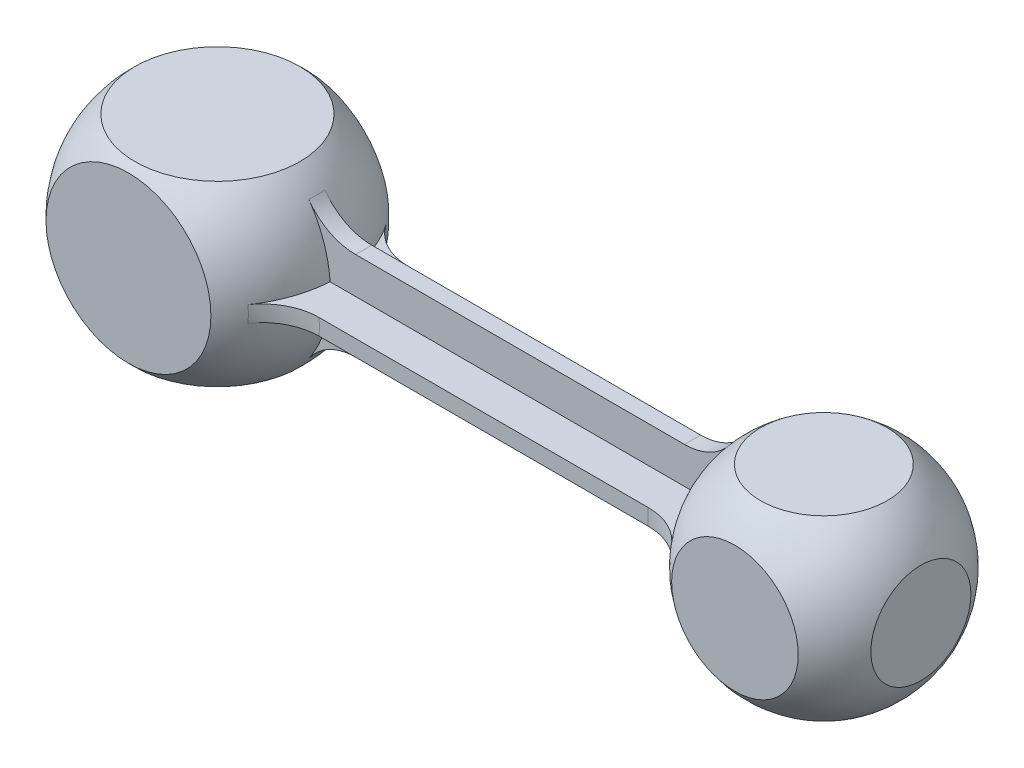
ISO-10303-21;
HEADER;
FILE_DESCRIPTION(('STEP AP214'),'2;1');
FILE_NAME('part.step','',(''),(''),'','','');
FILE_SCHEMA(('AUTOMOTIVE_DESIGN { 1 0 10303 214 1 1 1 1 }'));
ENDSEC;
DATA;
#1=APPLICATION_CONTEXT('core data for automotive mechanical design processes');
#2=APPLICATION_PROTOCOL_DEFINITION('international standard','automotive_design',2000,#1);
#3=PRODUCT_CONTEXT('',#1,'mechanical');
#4=PRODUCT('Part','Part','',(#3));
#5=PRODUCT_RELATED_PRODUCT_CATEGORY('part','',(#4));
#6=PRODUCT_DEFINITION_FORMATION('','',#4);
#7=PRODUCT_DEFINITION_CONTEXT('part definition',#1,'design');
#8=PRODUCT_DEFINITION('design','',#6,#7);
#9=PRODUCT_DEFINITION_SHAPE('','',#8);
#10=(LENGTH_UNIT() NAMED_UNIT(*) SI_UNIT(.MILLI.,.METRE.));
#11=(NAMED_UNIT(*) PLANE_ANGLE_UNIT() SI_UNIT($,.RADIAN.));
#12=(NAMED_UNIT(*) SI_UNIT($,.STERADIAN.) SOLID_ANGLE_UNIT());
#13=UNCERTAINTY_MEASURE_WITH_UNIT(LENGTH_MEASURE(1.E-05),#10,'distance_accuracy_value','');
#14=(GEOMETRIC_REPRESENTATION_CONTEXT(3) GLOBAL_UNCERTAINTY_ASSIGNED_CONTEXT((#13)) GLOBAL_UNIT_ASSIGNED_CONTEXT((#10,
#11,#12)) REPRESENTATION_CONTEXT('',''));
#15=CARTESIAN_POINT('',(0.,0.,0.));
#16=DIRECTION('',(0.,0.,1.));
#17=DIRECTION('',(1.,0.,0.));
#18=AXIS2_PLACEMENT_3D('',#15,#16,#17);
#19=CARTESIAN_POINT('',(0.,0.,0.));
#20=DIRECTION('',(1.,0.,0.));
#21=DIRECTION('',(0.,0.,1.));
#22=AXIS2_PLACEMENT_3D('',#19,#20,#21);
#23=SPHERICAL_SURFACE('',#22,15.);
#24=CARTESIAN_POINT('',(0.,0.,-11.));
#25=DIRECTION('',(0.,0.,-1.));
#26=DIRECTION('',(-1.,0.,0.));
#27=AXIS2_PLACEMENT_3D('',#24,#25,#26);
#28=CIRCLE('',#27,10.1980390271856);
#29=CARTESIAN_POINT('',(-10.1980390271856,0.,-11.));
#30=VERTEX_POINT('',#29);
#31=EDGE_CURVE('E227',#30,#30,#28,.F.);
#32=ORIENTED_EDGE('',*,*,#31,.T.);
#33=EDGE_LOOP('',(#32));
#34=FACE_BOUND('',#33,.T.);
#35=CARTESIAN_POINT('',(-13.,0.,0.));
#36=DIRECTION('',(-1.,0.,0.));
#37=DIRECTION('',(0.,0.,1.));
#38=AXIS2_PLACEMENT_3D('',#35,#36,#37);
#39=CIRCLE('',#38,7.48331477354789);
#40=CARTESIAN_POINT('',(-13.,0.,7.48331477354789));
#41=VERTEX_POINT('',#40);
#42=EDGE_CURVE('E223',#41,#41,#39,.F.);
#43=ORIENTED_EDGE('',*,*,#42,.T.);
#44=EDGE_LOOP('',(#43));
#45=FACE_BOUND('',#44,.T.);
#46=CARTESIAN_POINT('',(0.,0.,-1.));
#47=DIRECTION('',(0.,0.,-1.));
#48=DIRECTION('',(0.,1.,0.));
#49=AXIS2_PLACEMENT_3D('',#46,#47,#48);
#50=CIRCLE('',#49,14.9666295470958);
#51=CARTESIAN_POINT('',(12.3029719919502,-8.52272727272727,-1.00000000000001));
#52=VERTEX_POINT('',#51);
#53=CARTESIAN_POINT('',(14.9331845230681,-0.999999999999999,-1.));
#54=VERTEX_POINT('',#53);
#55=EDGE_CURVE('E48',#52,#54,#50,.F.);
#56=ORIENTED_EDGE('',*,*,#55,.F.);
#57=CARTESIAN_POINT('',(0.,-8.52272727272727,0.));
#58=DIRECTION('',(0.,1.,0.));
#59=DIRECTION('',(0.,0.,1.));
#60=AXIS2_PLACEMENT_3D('',#57,#58,#59);
#61=CIRCLE('',#60,12.343545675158);
#62=CARTESIAN_POINT('',(12.3029719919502,-8.52272727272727,0.999999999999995));
#63=VERTEX_POINT('',#62);
#64=EDGE_CURVE('E190',#52,#63,#61,.F.);
#65=ORIENTED_EDGE('',*,*,#64,.T.);
#66=CARTESIAN_POINT('',(0.,0.,0.999999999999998));
#67=DIRECTION('',(0.,0.,-1.));
#68=DIRECTION('',(0.,1.,0.));
#69=AXIS2_PLACEMENT_3D('',#66,#67,#68);
#70=CIRCLE('',#69,14.9666295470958);
#71=CARTESIAN_POINT('',(14.9331845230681,-0.999999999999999,0.999999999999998));
#72=VERTEX_POINT('',#71);
#73=EDGE_CURVE('E56',#63,#72,#70,.F.);
#74=ORIENTED_EDGE('',*,*,#73,.T.);
#75=CARTESIAN_POINT('',(0.,-0.999999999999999,0.));
#76=DIRECTION('',(0.,1.,0.));
#77=DIRECTION('',(0.,0.,1.));
#78=AXIS2_PLACEMENT_3D('',#75,#76,#77);
#79=CIRCLE('',#78,14.9666295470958);
#80=CARTESIAN_POINT('',(12.3029719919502,-1.,8.52272727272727));
#81=VERTEX_POINT('',#80);
#82=EDGE_CURVE('E171',#72,#81,#79,.F.);
#83=ORIENTED_EDGE('',*,*,#82,.T.);
#84=CARTESIAN_POINT('',(0.,0.,8.52272727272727));
#85=DIRECTION('',(0.,0.,-1.));
#86=DIRECTION('',(-1.,0.,0.));
#87=AXIS2_PLACEMENT_3D('',#84,#85,#86);
#88=CIRCLE('',#87,12.343545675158);
#89=CARTESIAN_POINT('',(12.3029719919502,1.,8.52272727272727));
#90=VERTEX_POINT('',#89);
#91=EDGE_CURVE('E269',#81,#90,#88,.F.);
#92=ORIENTED_EDGE('',*,*,#91,.T.);
#93=CARTESIAN_POINT('',(0.,1.,0.));
#94=DIRECTION('',(0.,1.,0.));
#95=DIRECTION('',(0.,0.,1.));
#96=AXIS2_PLACEMENT_3D('',#93,#94,#95);
#97=CIRCLE('',#96,14.9666295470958);
#98=CARTESIAN_POINT('',(14.9331845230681,1.,0.999999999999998));
#99=VERTEX_POINT('',#98);
#100=EDGE_CURVE('E179',#99,#90,#97,.F.);
#101=ORIENTED_EDGE('',*,*,#100,.F.);
#102=CARTESIAN_POINT('',(12.3029719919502,8.52272727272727,1.));
#103=VERTEX_POINT('',#102);
#104=EDGE_CURVE('E193',#99,#103,#70,.F.);
#105=ORIENTED_EDGE('',*,*,#104,.T.);
#106=CARTESIAN_POINT('',(0.,8.52272727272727,0.));
#107=DIRECTION('',(0.,-1.,0.));
#108=DIRECTION('',(0.,0.,-1.));
#109=AXIS2_PLACEMENT_3D('',#106,#107,#108);
#110=CIRCLE('',#109,12.343545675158);
#111=CARTESIAN_POINT('',(12.3029719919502,8.52272727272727,-0.999999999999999));
#112=VERTEX_POINT('',#111);
#113=EDGE_CURVE('E266',#103,#112,#110,.F.);
#114=ORIENTED_EDGE('',*,*,#113,.T.);
#115=CARTESIAN_POINT('',(14.9331845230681,1.,-1.));
#116=VERTEX_POINT('',#115);
#117=EDGE_CURVE('E192',#116,#112,#50,.F.);
#118=ORIENTED_EDGE('',*,*,#117,.F.);
#119=CARTESIAN_POINT('',(12.3029719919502,1.,-8.52272727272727));
#120=VERTEX_POINT('',#119);
#121=EDGE_CURVE('E201',#120,#116,#97,.F.);
#122=ORIENTED_EDGE('',*,*,#121,.F.);
#123=CARTESIAN_POINT('',(0.,0.,-8.52272727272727));
#124=DIRECTION('',(0.,0.,1.));
#125=DIRECTION('',(1.,0.,0.));
#126=AXIS2_PLACEMENT_3D('',#123,#124,#125);
#127=CIRCLE('',#126,12.343545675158);
#128=CARTESIAN_POINT('',(12.3029719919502,-0.999999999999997,-8.52272727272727));
#129=VERTEX_POINT('',#128);
#130=EDGE_CURVE('E271',#120,#129,#127,.F.);
#131=ORIENTED_EDGE('',*,*,#130,.T.);
#132=EDGE_CURVE('E181',#129,#54,#79,.F.);
#133=ORIENTED_EDGE('',*,*,#132,.T.);
#134=EDGE_LOOP('',(#56,#65,#74,#83,#92,#101,#105,#114,#118,#122,#131,#133));
#135=FACE_BOUND('',#134,.T.);
#136=CARTESIAN_POINT('',(0.,11.,0.));
#137=DIRECTION('',(0.,-1.,0.));
#138=DIRECTION('',(0.,0.,-1.));
#139=AXIS2_PLACEMENT_3D('',#136,#137,#138);
#140=CIRCLE('',#139,10.1980390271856);
#141=CARTESIAN_POINT('',(0.,11.,-10.1980390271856));
#142=VERTEX_POINT('',#141);
#143=EDGE_CURVE('E210',#142,#142,#140,.F.);
#144=ORIENTED_EDGE('',*,*,#143,.F.);
#145=EDGE_LOOP('',(#144));
#146=FACE_BOUND('',#145,.T.);
#147=CARTESIAN_POINT('',(0.,-11.,0.));
#148=DIRECTION('',(0.,1.,0.));
#149=DIRECTION('',(0.,0.,1.));
#150=AXIS2_PLACEMENT_3D('',#147,#148,#149);
#151=CIRCLE('',#150,10.1980390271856);
#152=CARTESIAN_POINT('',(0.,-11.,10.1980390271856));
#153=VERTEX_POINT('',#152);
#154=EDGE_CURVE('E213',#153,#153,#151,.F.);
#155=ORIENTED_EDGE('',*,*,#154,.F.);
#156=EDGE_LOOP('',(#155));
#157=FACE_BOUND('',#156,.T.);
#158=CARTESIAN_POINT('',(0.,0.,11.));
#159=DIRECTION('',(0.,0.,1.));
#160=DIRECTION('',(1.,0.,0.));
#161=AXIS2_PLACEMENT_3D('',#158,#159,#160);
#162=CIRCLE('',#161,10.1980390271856);
#163=CARTESIAN_POINT('',(10.1980390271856,0.,11.));
#164=VERTEX_POINT('',#163);
#165=EDGE_CURVE('E220',#164,#164,#162,.F.);
#166=ORIENTED_EDGE('',*,*,#165,.T.);
#167=EDGE_LOOP('',(#166));
#168=FACE_BOUND('',#167,.T.);
#169=ADVANCED_FACE('F29',(#34,#45,#135,#146,#157,#168),#23,.T.);
#170=CARTESIAN_POINT('',(75.,0.,0.));
#171=DIRECTION('',(0.,0.,1.));
#172=DIRECTION('',(0.,1.,0.));
#173=AXIS2_PLACEMENT_3D('',#170,#171,#172);
#174=SPHERICAL_SURFACE('',#173,13.5);
#175=CARTESIAN_POINT('',(75.,0.,-11.));
#176=DIRECTION('',(0.,0.,-1.));
#177=DIRECTION('',(-1.,0.,0.));
#178=AXIS2_PLACEMENT_3D('',#175,#176,#177);
#179=CIRCLE('',#178,7.82623792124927);
#180=CARTESIAN_POINT('',(67.1737620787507,0.,-11.));
#181=VERTEX_POINT('',#180);
#182=EDGE_CURVE('E224',#181,#181,#179,.T.);
#183=ORIENTED_EDGE('',*,*,#182,.F.);
#184=EDGE_LOOP('',(#183));
#185=FACE_BOUND('',#184,.T.);
#186=CARTESIAN_POINT('',(87.,0.,0.));
#187=DIRECTION('',(1.,0.,0.));
#188=DIRECTION('',(0.,0.,-1.));
#189=AXIS2_PLACEMENT_3D('',#186,#187,#188);
#190=CIRCLE('',#189,6.1846584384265);
#191=CARTESIAN_POINT('',(87.,0.,-6.1846584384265));
#192=VERTEX_POINT('',#191);
#193=EDGE_CURVE('E216',#192,#192,#190,.T.);
#194=ORIENTED_EDGE('',*,*,#193,.F.);
#195=EDGE_LOOP('',(#194));
#196=FACE_BOUND('',#195,.T.);
#197=CARTESIAN_POINT('',(75.,-0.999999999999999,0.));
#198=DIRECTION('',(0.,1.,0.));
#199=DIRECTION('',(0.,0.,1.));
#200=AXIS2_PLACEMENT_3D('',#197,#198,#199);
#201=CIRCLE('',#200,13.4629120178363);
#202=CARTESIAN_POINT('',(61.5742784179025,-0.999999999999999,-1.));
#203=VERTEX_POINT('',#202);
#204=CARTESIAN_POINT('',(64.3468786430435,-0.999999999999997,-8.23170731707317));
#205=VERTEX_POINT('',#204);
#206=EDGE_CURVE('E202',#203,#205,#201,.F.);
#207=ORIENTED_EDGE('',*,*,#206,.T.);
#208=CARTESIAN_POINT('',(75.,0.,-8.23170731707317));
#209=DIRECTION('',(0.,0.,1.));
#210=DIRECTION('',(1.,0.,0.));
#211=AXIS2_PLACEMENT_3D('',#208,#209,#210);
#212=CIRCLE('',#211,10.69995302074);
#213=CARTESIAN_POINT('',(64.3468786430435,1.,-8.23170731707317));
#214=VERTEX_POINT('',#213);
#215=EDGE_CURVE('E245',#205,#214,#212,.F.);
#216=ORIENTED_EDGE('',*,*,#215,.T.);
#217=CARTESIAN_POINT('',(75.,1.,0.));
#218=DIRECTION('',(0.,1.,0.));
#219=DIRECTION('',(0.,0.,1.));
#220=AXIS2_PLACEMENT_3D('',#217,#218,#219);
#221=CIRCLE('',#220,13.4629120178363);
#222=CARTESIAN_POINT('',(61.5742784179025,1.,-1.));
#223=VERTEX_POINT('',#222);
#224=EDGE_CURVE('E618',#223,#214,#221,.F.);
#225=ORIENTED_EDGE('',*,*,#224,.F.);
#226=CARTESIAN_POINT('',(75.,0.,-1.));
#227=DIRECTION('',(0.,0.,-1.));
#228=DIRECTION('',(0.,1.,0.));
#229=AXIS2_PLACEMENT_3D('',#226,#227,#228);
#230=CIRCLE('',#229,13.4629120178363);
#231=CARTESIAN_POINT('',(64.3468786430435,8.23170731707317,-0.999999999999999));
#232=VERTEX_POINT('',#231);
#233=EDGE_CURVE('E660',#232,#223,#230,.F.);
#234=ORIENTED_EDGE('',*,*,#233,.F.);
#235=CARTESIAN_POINT('',(75.,8.23170731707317,0.));
#236=DIRECTION('',(0.,-1.,0.));
#237=DIRECTION('',(0.,0.,-1.));
#238=AXIS2_PLACEMENT_3D('',#235,#236,#237);
#239=CIRCLE('',#238,10.69995302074);
#240=CARTESIAN_POINT('',(64.3468786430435,8.23170731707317,1.));
#241=VERTEX_POINT('',#240);
#242=EDGE_CURVE('E242',#232,#241,#239,.F.);
#243=ORIENTED_EDGE('',*,*,#242,.T.);
#244=CARTESIAN_POINT('',(75.,0.,0.999999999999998));
#245=DIRECTION('',(0.,0.,-1.));
#246=DIRECTION('',(0.,1.,0.));
#247=AXIS2_PLACEMENT_3D('',#244,#245,#246);
#248=CIRCLE('',#247,13.4629120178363);
#249=CARTESIAN_POINT('',(61.5742784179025,1.,0.999999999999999));
#250=VERTEX_POINT('',#249);
#251=EDGE_CURVE('E659',#241,#250,#248,.F.);
#252=ORIENTED_EDGE('',*,*,#251,.T.);
#253=CARTESIAN_POINT('',(75.,1.,0.));
#254=DIRECTION('',(0.,1.,0.));
#255=DIRECTION('',(0.,0.,1.));
#256=AXIS2_PLACEMENT_3D('',#253,#254,#255);
#257=CIRCLE('',#256,13.4629120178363);
#258=CARTESIAN_POINT('',(64.3468786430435,1.,8.23170731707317));
#259=VERTEX_POINT('',#258);
#260=EDGE_CURVE('E669',#259,#250,#257,.F.);
#261=ORIENTED_EDGE('',*,*,#260,.F.);
#262=CARTESIAN_POINT('',(75.,0.,8.23170731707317));
#263=DIRECTION('',(0.,0.,-1.));
#264=DIRECTION('',(-1.,0.,0.));
#265=AXIS2_PLACEMENT_3D('',#262,#263,#264);
#266=CIRCLE('',#265,10.69995302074);
#267=CARTESIAN_POINT('',(64.3468786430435,-1.,8.23170731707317));
#268=VERTEX_POINT('',#267);
#269=EDGE_CURVE('E239',#259,#268,#266,.F.);
#270=ORIENTED_EDGE('',*,*,#269,.T.);
#271=CARTESIAN_POINT('',(75.,-0.999999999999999,0.));
#272=DIRECTION('',(0.,1.,0.));
#273=DIRECTION('',(0.,0.,1.));
#274=AXIS2_PLACEMENT_3D('',#271,#272,#273);
#275=CIRCLE('',#274,13.4629120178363);
#276=CARTESIAN_POINT('',(61.5742784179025,-0.999999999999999,0.999999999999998));
#277=VERTEX_POINT('',#276);
#278=EDGE_CURVE('E633',#268,#277,#275,.F.);
#279=ORIENTED_EDGE('',*,*,#278,.T.);
#280=CARTESIAN_POINT('',(75.,0.,0.999999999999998));
#281=DIRECTION('',(0.,0.,-1.));
#282=DIRECTION('',(0.,1.,0.));
#283=AXIS2_PLACEMENT_3D('',#280,#281,#282);
#284=CIRCLE('',#283,13.4629120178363);
#285=CARTESIAN_POINT('',(64.3468786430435,-8.23170731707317,0.999999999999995));
#286=VERTEX_POINT('',#285);
#287=EDGE_CURVE('E184',#277,#286,#284,.F.);
#288=ORIENTED_EDGE('',*,*,#287,.T.);
#289=CARTESIAN_POINT('',(75.,-8.23170731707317,0.));
#290=DIRECTION('',(0.,1.,0.));
#291=DIRECTION('',(0.,0.,1.));
#292=AXIS2_PLACEMENT_3D('',#289,#290,#291);
#293=CIRCLE('',#292,10.69995302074);
#294=CARTESIAN_POINT('',(64.3468786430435,-8.23170731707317,-1.));
#295=VERTEX_POINT('',#294);
#296=EDGE_CURVE('E236',#286,#295,#293,.F.);
#297=ORIENTED_EDGE('',*,*,#296,.T.);
#298=CARTESIAN_POINT('',(75.,0.,-1.));
#299=DIRECTION('',(0.,0.,-1.));
#300=DIRECTION('',(0.,1.,0.));
#301=AXIS2_PLACEMENT_3D('',#298,#299,#300);
#302=CIRCLE('',#301,13.4629120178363);
#303=EDGE_CURVE('E662',#203,#295,#302,.F.);
#304=ORIENTED_EDGE('',*,*,#303,.F.);
#305=EDGE_LOOP('',(#207,#216,#225,#234,#243,#252,#261,#270,#279,#288,#297,#304));
#306=FACE_BOUND('',#305,.T.);
#307=CARTESIAN_POINT('',(75.,11.,0.));
#308=DIRECTION('',(0.,-1.,0.));
#309=DIRECTION('',(0.,0.,-1.));
#310=AXIS2_PLACEMENT_3D('',#307,#308,#309);
#311=CIRCLE('',#310,7.82623792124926);
#312=CARTESIAN_POINT('',(75.,11.,-7.82623792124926));
#313=VERTEX_POINT('',#312);
#314=EDGE_CURVE('E204',#313,#313,#311,.T.);
#315=ORIENTED_EDGE('',*,*,#314,.T.);
#316=EDGE_LOOP('',(#315));
#317=FACE_BOUND('',#316,.T.);
#318=CARTESIAN_POINT('',(75.,-11.,0.));
#319=DIRECTION('',(0.,1.,0.));
#320=DIRECTION('',(0.,0.,1.));
#321=AXIS2_PLACEMENT_3D('',#318,#319,#320);
#322=CIRCLE('',#321,7.82623792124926);
#323=CARTESIAN_POINT('',(75.,-11.,7.82623792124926));
#324=VERTEX_POINT('',#323);
#325=EDGE_CURVE('E207',#324,#324,#322,.T.);
#326=ORIENTED_EDGE('',*,*,#325,.T.);
#327=EDGE_LOOP('',(#326));
#328=FACE_BOUND('',#327,.T.);
#329=CARTESIAN_POINT('',(75.,0.,11.));
#330=DIRECTION('',(0.,0.,1.));
#331=DIRECTION('',(1.,0.,0.));
#332=AXIS2_PLACEMENT_3D('',#329,#330,#331);
#333=CIRCLE('',#332,7.82623792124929);
#334=CARTESIAN_POINT('',(82.8262379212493,0.,11.));
#335=VERTEX_POINT('',#334);
#336=EDGE_CURVE('E217',#335,#335,#333,.T.);
#337=ORIENTED_EDGE('',*,*,#336,.F.);
#338=EDGE_LOOP('',(#337));
#339=FACE_BOUND('',#338,.T.);
#340=ADVANCED_FACE('F336',(#185,#196,#306,#317,#328,#339),#174,.T.);
#341=CARTESIAN_POINT('',(86.180339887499,5.5,-1.));
#342=DIRECTION('',(0.,0.,-1.));
#343=DIRECTION('',(0.,1.,0.));
#344=AXIS2_PLACEMENT_3D('',#341,#342,#343);
#345=PLANE('',#344);
#346=DIRECTION('',(1.,0.,0.));
#347=VECTOR('',#346,1.);
#348=CARTESIAN_POINT('',(86.180339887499,-0.999999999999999,-1.));
#349=LINE('',#348,#347);
#350=EDGE_CURVE('E185',#54,#203,#349,.T.);
#351=ORIENTED_EDGE('',*,*,#350,.T.);
#352=ORIENTED_EDGE('',*,*,#303,.T.);
#353=CARTESIAN_POINT('',(64.3468786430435,-8.23170731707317,-1.));
#354=CARTESIAN_POINT('',(64.2259920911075,-8.07522744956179,-1.));
#355=CARTESIAN_POINT('',(64.0984612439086,-7.92388730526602,-1.));
#356=CARTESIAN_POINT('',(63.8311054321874,-7.63249840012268,-1.));
#357=CARTESIAN_POINT('',(63.6912810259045,-7.49244912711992,-1.));
#358=CARTESIAN_POINT('',(63.400423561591,-7.22473353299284,-1.));
#359=CARTESIAN_POINT('',(63.2493984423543,-7.097058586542,-1.));
#360=CARTESIAN_POINT('',(62.9371409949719,-6.85487819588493,-1.));
#361=CARTESIAN_POINT('',(62.7759089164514,-6.74037242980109,-1.));
#362=CARTESIAN_POINT('',(62.4442644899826,-6.52526076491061,-1.));
#363=CARTESIAN_POINT('',(62.2738458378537,-6.42466458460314,-1.));
#364=CARTESIAN_POINT('',(61.9251445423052,-6.23817740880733,-1.));
#365=CARTESIAN_POINT('',(61.7468618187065,-6.15228656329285,-1.));
#366=CARTESIAN_POINT('',(61.3838083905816,-5.99587197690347,-1.));
#367=CARTESIAN_POINT('',(61.1990420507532,-5.92533811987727,-1.));
#368=CARTESIAN_POINT('',(60.824302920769,-5.80008494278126,-1.));
#369=CARTESIAN_POINT('',(60.6343312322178,-5.74536230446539,-1.));
#370=CARTESIAN_POINT('',(60.1709278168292,-5.6328033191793,-1.));
#371=CARTESIAN_POINT('',(59.895469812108,-5.5830375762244,-1.));
#372=CARTESIAN_POINT('',(59.4795970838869,-5.53324018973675,-1.));
#373=CARTESIAN_POINT('',(59.3405446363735,-5.52078293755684,-1.));
#374=CARTESIAN_POINT('',(59.0619169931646,-5.50416299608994,-1.));
#375=CARTESIAN_POINT('',(58.9223416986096,-5.50000196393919,-1.));
#376=CARTESIAN_POINT('',(58.7827252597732,-5.5,-1.));
#377=B_SPLINE_CURVE_WITH_KNOTS('',3,(#353,#354,#355,#356,#357,#358,#359,#360,#361,#362,#363,
#364,#365,#366,#367,#368,#369,#370,#371,#372,#373,#374,#375,#376),.UNSPECIFIED.,.F.,.F.,(4,2,2,
2,2,2,2,2,2,2,2,4),(0.,0.593024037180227,1.1860211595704,1.77860192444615,2.37116820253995,
2.96414643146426,3.55713070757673,4.14972317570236,4.74219118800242,5.57966613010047,
5.99828783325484,6.41699314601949),.UNSPECIFIED.);
#378=CARTESIAN_POINT('',(58.7827252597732,-5.5,-1.));
#379=VERTEX_POINT('',#378);
#380=EDGE_CURVE('E595',#295,#379,#377,.T.);
#381=ORIENTED_EDGE('',*,*,#380,.T.);
#382=DIRECTION('',(-1.,0.,0.));
#383=VECTOR('',#382,1.);
#384=CARTESIAN_POINT('',(86.180339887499,-5.5,-1.));
#385=LINE('',#384,#383);
#386=CARTESIAN_POINT('',(18.0762274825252,-5.5,-1.));
#387=VERTEX_POINT('',#386);
#388=EDGE_CURVE('E648',#379,#387,#385,.T.);
#389=ORIENTED_EDGE('',*,*,#388,.T.);
#390=CARTESIAN_POINT('',(18.0762274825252,-5.5,-1.));
#391=CARTESIAN_POINT('',(17.8785846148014,-5.49997884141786,-1.));
#392=CARTESIAN_POINT('',(17.6809451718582,-5.50834414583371,-1.));
#393=CARTESIAN_POINT('',(17.2870813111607,-5.54168976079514,-1.));
#394=CARTESIAN_POINT('',(17.0908568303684,-5.56666932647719,-1.));
#395=CARTESIAN_POINT('',(16.7014334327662,-5.63304801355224,-1.));
#396=CARTESIAN_POINT('',(16.5082313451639,-5.67442853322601,-1.));
#397=CARTESIAN_POINT('',(16.1260001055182,-5.77330497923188,-1.));
#398=CARTESIAN_POINT('',(15.9369708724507,-5.8308005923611,-1.));
#399=CARTESIAN_POINT('',(15.5643252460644,-5.96153355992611,-1.));
#400=CARTESIAN_POINT('',(15.3807117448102,-6.03477915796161,-1.));
#401=CARTESIAN_POINT('',(15.0202209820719,-6.19651123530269,-1.));
#402=CARTESIAN_POINT('',(14.8433468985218,-6.28500479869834,-1.));
#403=CARTESIAN_POINT('',(14.4977449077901,-6.47654686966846,-1.));
#404=CARTESIAN_POINT('',(14.3290142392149,-6.57959039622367,-1.));
#405=CARTESIAN_POINT('',(14.0009116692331,-6.7994767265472,-1.));
#406=CARTESIAN_POINT('',(13.8415350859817,-6.916312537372,-1.));
#407=CARTESIAN_POINT('',(13.5549018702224,-7.14562209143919,-1.));
#408=CARTESIAN_POINT('',(13.4262810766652,-7.25639659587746,-1.));
#409=CARTESIAN_POINT('',(13.1774094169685,-7.48696188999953,-1.));
#410=CARTESIAN_POINT('',(13.0571576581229,-7.60675171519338,-1.));
#411=CARTESIAN_POINT('',(12.8256135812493,-7.85477530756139,-1.));
#412=CARTESIAN_POINT('',(12.7143244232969,-7.98301202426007,-1.));
#413=CARTESIAN_POINT('',(12.5013182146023,-8.24723217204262,-1.));
#414=CARTESIAN_POINT('',(12.3996024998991,-8.38321668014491,-1.));
#415=CARTESIAN_POINT('',(12.3029719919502,-8.52272727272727,-1.));
#416=B_SPLINE_CURVE_WITH_KNOTS('',3,(#390,#391,#392,#393,#394,#395,#396,#397,#398,#399,#400,
#401,#402,#403,#404,#405,#406,#407,#408,#409,#410,#411,#412,#413,#414,#415),.UNSPECIFIED.,.F.,
.F.,(4,2,2,2,2,2,2,2,2,2,2,2,4),(0.,0.592746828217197,1.18546708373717,1.77751699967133,
2.3695554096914,2.96190445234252,3.55452944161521,4.14695204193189,4.73907555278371,
5.2478863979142,5.75664288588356,6.26557797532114,6.77458398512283),.UNSPECIFIED.);
#417=EDGE_CURVE('E581',#387,#52,#416,.T.);
#418=ORIENTED_EDGE('',*,*,#417,.T.);
#419=ORIENTED_EDGE('',*,*,#55,.T.);
#420=EDGE_LOOP('',(#351,#352,#381,#389,#418,#419));
#421=FACE_BOUND('',#420,.T.);
#422=ADVANCED_FACE('F338',(#421),#345,.T.);
#423=CARTESIAN_POINT('',(86.180339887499,5.5,1.));
#424=DIRECTION('',(0.,0.,-1.));
#425=DIRECTION('',(0.,1.,0.));
#426=AXIS2_PLACEMENT_3D('',#423,#424,#425);
#427=PLANE('',#426);
#428=ORIENTED_EDGE('',*,*,#287,.F.);
#429=DIRECTION('',(1.,0.,0.));
#430=VECTOR('',#429,1.);
#431=CARTESIAN_POINT('',(86.180339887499,-0.999999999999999,0.999999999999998));
#432=LINE('',#431,#430);
#433=EDGE_CURVE('E173',#72,#277,#432,.T.);
#434=ORIENTED_EDGE('',*,*,#433,.F.);
#435=ORIENTED_EDGE('',*,*,#73,.F.);
#436=CARTESIAN_POINT('',(12.3029719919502,-8.52272727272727,0.999999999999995));
#437=CARTESIAN_POINT('',(12.4154142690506,-8.36037463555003,0.999999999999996));
#438=CARTESIAN_POINT('',(12.5347517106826,-8.20280365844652,0.999999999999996));
#439=CARTESIAN_POINT('',(12.7862773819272,-7.89828899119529,0.999999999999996));
#440=CARTESIAN_POINT('',(12.918464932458,-7.75134474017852,0.999999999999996));
#441=CARTESIAN_POINT('',(13.1945984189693,-7.46929858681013,0.999999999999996));
#442=CARTESIAN_POINT('',(13.3385301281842,-7.33418275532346,0.999999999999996));
#443=CARTESIAN_POINT('',(13.6372523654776,-7.07654728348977,0.999999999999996));
#444=CARTESIAN_POINT('',(13.7920427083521,-6.95402742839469,0.999999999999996));
#445=CARTESIAN_POINT('',(14.1114607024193,-6.72238980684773,0.999999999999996));
#446=CARTESIAN_POINT('',(14.2760931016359,-6.6132785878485,0.999999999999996));
#447=CARTESIAN_POINT('',(14.6140351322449,-6.40925015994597,0.999999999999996));
#448=CARTESIAN_POINT('',(14.7873487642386,-6.31433957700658,0.999999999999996));
#449=CARTESIAN_POINT('',(15.1412942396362,-6.13947238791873,0.999999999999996));
#450=CARTESIAN_POINT('',(15.3219238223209,-6.05951120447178,0.999999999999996));
#451=CARTESIAN_POINT('',(15.6891862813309,-5.91510795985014,0.999999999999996));
#452=CARTESIAN_POINT('',(15.8758160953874,-5.85065812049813,0.999999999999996));
#453=CARTESIAN_POINT('',(16.2276786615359,-5.74550041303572,0.999999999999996));
#454=CARTESIAN_POINT('',(16.3923023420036,-5.70274202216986,0.999999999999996));
#455=CARTESIAN_POINT('',(16.7242049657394,-5.6292766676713,0.999999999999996));
#456=CARTESIAN_POINT('',(16.8914836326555,-5.59856845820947,0.999999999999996));
#457=CARTESIAN_POINT('',(17.2278798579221,-5.54935950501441,0.999999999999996));
#458=CARTESIAN_POINT('',(17.3969979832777,-5.5308626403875,0.999999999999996));
#459=CARTESIAN_POINT('',(17.7361523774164,-5.50617636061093,0.999999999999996));
#460=CARTESIAN_POINT('',(17.9061887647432,-5.49998857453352,0.999999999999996));
#461=CARTESIAN_POINT('',(18.0762274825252,-5.5,0.999999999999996));
#462=B_SPLINE_CURVE_WITH_KNOTS('',3,(#436,#437,#438,#439,#440,#441,#442,#443,#444,#445,#446,
#447,#448,#449,#450,#451,#452,#453,#454,#455,#456,#457,#458,#459,#460,#461),.UNSPECIFIED.,.F.,
.F.,(4,2,2,2,2,2,2,2,2,2,2,2,4),(0.,0.592281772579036,1.18453226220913,1.77607566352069,
2.36760897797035,2.95943000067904,3.55152630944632,4.1434410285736,4.73505831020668,
5.24488160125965,5.75465216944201,6.26458459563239,6.77458450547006),.UNSPECIFIED.);
#463=CARTESIAN_POINT('',(18.0762274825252,-5.5,0.999999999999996));
#464=VERTEX_POINT('',#463);
#465=EDGE_CURVE('E574',#63,#464,#462,.T.);
#466=ORIENTED_EDGE('',*,*,#465,.T.);
#467=DIRECTION('',(-1.,0.,0.));
#468=VECTOR('',#467,1.);
#469=CARTESIAN_POINT('',(86.180339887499,-5.5,0.999999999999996));
#470=LINE('',#469,#468);
#471=CARTESIAN_POINT('',(58.7827252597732,-5.5,0.999999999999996));
#472=VERTEX_POINT('',#471);
#473=EDGE_CURVE('E645',#472,#464,#470,.T.);
#474=ORIENTED_EDGE('',*,*,#473,.F.);
#475=CARTESIAN_POINT('',(58.7827252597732,-5.5,0.999999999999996));
#476=CARTESIAN_POINT('',(58.9805368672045,-5.4999788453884,0.999999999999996));
#477=CARTESIAN_POINT('',(59.1783447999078,-5.50835222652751,0.999999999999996));
#478=CARTESIAN_POINT('',(59.5725454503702,-5.54172817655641,0.999999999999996));
#479=CARTESIAN_POINT('',(59.7689382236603,-5.56673008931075,0.999999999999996));
#480=CARTESIAN_POINT('',(60.1587851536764,-5.63318085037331,0.999999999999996));
#481=CARTESIAN_POINT('',(60.3522412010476,-5.67461860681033,0.999999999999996));
#482=CARTESIAN_POINT('',(60.7349719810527,-5.7736336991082,0.999999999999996));
#483=CARTESIAN_POINT('',(60.9242468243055,-5.8312106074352,0.999999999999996));
#484=CARTESIAN_POINT('',(61.2974124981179,-5.96214167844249,0.999999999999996));
#485=CARTESIAN_POINT('',(61.4812993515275,-6.03550717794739,0.999999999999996));
#486=CARTESIAN_POINT('',(61.8422398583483,-6.19746572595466,0.999999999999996));
#487=CARTESIAN_POINT('',(62.0192934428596,-6.28605892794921,0.999999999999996));
#488=CARTESIAN_POINT('',(62.3651976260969,-6.47778692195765,0.999999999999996));
#489=CARTESIAN_POINT('',(62.5340536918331,-6.58091183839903,0.999999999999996));
#490=CARTESIAN_POINT('',(62.8624258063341,-6.80096375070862,0.999999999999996));
#491=CARTESIAN_POINT('',(63.0219438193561,-6.91788782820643,0.999999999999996));
#492=CARTESIAN_POINT('',(63.3941312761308,-7.21563214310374,0.999999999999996));
#493=CARTESIAN_POINT('',(63.6016804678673,-7.40295469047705,0.999999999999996));
#494=CARTESIAN_POINT('',(63.8950132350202,-7.70123115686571,0.999999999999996));
#495=CARTESIAN_POINT('',(63.9897808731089,-7.80352394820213,0.999999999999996));
#496=CARTESIAN_POINT('',(64.1730804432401,-8.01358835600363,0.999999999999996));
#497=CARTESIAN_POINT('',(64.2616111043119,-8.12136108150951,0.999999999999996));
#498=CARTESIAN_POINT('',(64.3468786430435,-8.23170731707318,0.999999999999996));
#499=B_SPLINE_CURVE_WITH_KNOTS('',3,(#475,#476,#477,#478,#479,#480,#481,#482,#483,#484,#485,
#486,#487,#488,#489,#490,#491,#492,#493,#494,#495,#496,#497,#498),.UNSPECIFIED.,.F.,.F.,(4,2,2,
2,2,2,2,2,2,2,2,4),(0.,0.593252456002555,1.18648150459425,1.77931088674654,2.37212456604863,
2.96536533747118,3.5586120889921,4.15145760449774,4.74417796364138,5.58065490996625,
5.99878179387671,6.41699363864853),.UNSPECIFIED.);
#500=EDGE_CURVE('E567',#472,#286,#499,.T.);
#501=ORIENTED_EDGE('',*,*,#500,.T.);
#502=EDGE_LOOP('',(#428,#434,#435,#466,#474,#501));
#503=FACE_BOUND('',#502,.T.);
#504=ADVANCED_FACE('F182',(#503),#427,.F.);
#505=CARTESIAN_POINT('',(86.180339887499,5.5,1.));
#506=DIRECTION('',(0.,1.,0.));
#507=DIRECTION('',(0.,0.,1.));
#508=AXIS2_PLACEMENT_3D('',#505,#506,#507);
#509=PLANE('',#508);
#510=DIRECTION('',(-1.,0.,0.));
#511=VECTOR('',#510,1.);
#512=CARTESIAN_POINT('',(86.180339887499,5.5,1.));
#513=LINE('',#512,#511);
#514=CARTESIAN_POINT('',(58.7827252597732,5.5,1.));
#515=VERTEX_POINT('',#514);
#516=CARTESIAN_POINT('',(18.0762274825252,5.5,1.));
#517=VERTEX_POINT('',#516);
#518=EDGE_CURVE('E196',#515,#517,#513,.T.);
#519=ORIENTED_EDGE('',*,*,#518,.F.);
#520=CARTESIAN_POINT('',(75.,5.5,0.));
#521=DIRECTION('',(0.,1.,0.));
#522=DIRECTION('',(0.,0.,1.));
#523=AXIS2_PLACEMENT_3D('',#520,#521,#522);
#524=CIRCLE('',#523,16.2480768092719);
#525=CARTESIAN_POINT('',(58.7827252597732,5.5,-1.));
#526=VERTEX_POINT('',#525);
#527=EDGE_CURVE('E251',#515,#526,#524,.F.);
#528=ORIENTED_EDGE('',*,*,#527,.T.);
#529=DIRECTION('',(-1.,0.,0.));
#530=VECTOR('',#529,1.);
#531=CARTESIAN_POINT('',(86.180339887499,5.5,-1.));
#532=LINE('',#531,#530);
#533=CARTESIAN_POINT('',(18.0762274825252,5.5,-1.));
#534=VERTEX_POINT('',#533);
#535=EDGE_CURVE('E644',#526,#534,#532,.T.);
#536=ORIENTED_EDGE('',*,*,#535,.T.);
#537=CARTESIAN_POINT('',(0.,5.5,0.));
#538=DIRECTION('',(0.,1.,0.));
#539=DIRECTION('',(0.,0.,1.));
#540=AXIS2_PLACEMENT_3D('',#537,#538,#539);
#541=CIRCLE('',#540,18.1038669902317);
#542=EDGE_CURVE('E248',#534,#517,#541,.F.);
#543=ORIENTED_EDGE('',*,*,#542,.T.);
#544=EDGE_LOOP('',(#519,#528,#536,#543));
#545=FACE_BOUND('',#544,.T.);
#546=ADVANCED_FACE('F418',(#545),#509,.T.);
#547=ORIENTED_EDGE('',*,*,#535,.F.);
#548=CARTESIAN_POINT('',(58.7827252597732,5.5,-1.));
#549=CARTESIAN_POINT('',(58.9805368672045,5.4999788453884,-1.));
#550=CARTESIAN_POINT('',(59.1783447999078,5.50835222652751,-1.));
#551=CARTESIAN_POINT('',(59.5725454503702,5.54172817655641,-1.));
#552=CARTESIAN_POINT('',(59.7689382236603,5.56673008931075,-1.));
#553=CARTESIAN_POINT('',(60.1587851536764,5.63318085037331,-1.));
#554=CARTESIAN_POINT('',(60.3522412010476,5.67461860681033,-1.));
#555=CARTESIAN_POINT('',(60.7349719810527,5.7736336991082,-1.));
#556=CARTESIAN_POINT('',(60.9242468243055,5.8312106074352,-1.));
#557=CARTESIAN_POINT('',(61.2974124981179,5.96214167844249,-1.));
#558=CARTESIAN_POINT('',(61.4812993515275,6.03550717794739,-1.));
#559=CARTESIAN_POINT('',(61.8422398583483,6.19746572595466,-1.));
#560=CARTESIAN_POINT('',(62.0192934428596,6.28605892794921,-1.));
#561=CARTESIAN_POINT('',(62.3651976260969,6.47778692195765,-1.));
#562=CARTESIAN_POINT('',(62.5340536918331,6.58091183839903,-1.));
#563=CARTESIAN_POINT('',(62.8624258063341,6.80096375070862,-1.));
#564=CARTESIAN_POINT('',(63.0219438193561,6.91788782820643,-1.));
#565=CARTESIAN_POINT('',(63.3941312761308,7.21563214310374,-1.));
#566=CARTESIAN_POINT('',(63.6016804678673,7.40295469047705,-1.));
#567=CARTESIAN_POINT('',(63.8950132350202,7.70123115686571,-1.));
#568=CARTESIAN_POINT('',(63.9897808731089,7.80352394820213,-1.));
#569=CARTESIAN_POINT('',(64.1730804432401,8.01358835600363,-1.));
#570=CARTESIAN_POINT('',(64.2616111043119,8.12136108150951,-1.));
#571=CARTESIAN_POINT('',(64.3468786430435,8.23170731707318,-0.999999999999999));
#572=B_SPLINE_CURVE_WITH_KNOTS('',3,(#548,#549,#550,#551,#552,#553,#554,#555,#556,#557,#558,
#559,#560,#561,#562,#563,#564,#565,#566,#567,#568,#569,#570,#571),.UNSPECIFIED.,.F.,.F.,(4,2,2,
2,2,2,2,2,2,2,2,4),(0.,0.593252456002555,1.18648150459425,1.77931088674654,2.37212456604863,
2.96536533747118,3.5586120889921,4.15145760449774,4.74417796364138,5.58065490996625,
5.99878179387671,6.41699363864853),.UNSPECIFIED.);
#573=EDGE_CURVE('E602',#526,#232,#572,.T.);
#574=ORIENTED_EDGE('',*,*,#573,.T.);
#575=ORIENTED_EDGE('',*,*,#233,.T.);
#576=DIRECTION('',(1.,0.,0.));
#577=VECTOR('',#576,1.);
#578=CARTESIAN_POINT('',(86.180339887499,1.,-1.));
#579=LINE('',#578,#577);
#580=EDGE_CURVE('E642',#116,#223,#579,.T.);
#581=ORIENTED_EDGE('',*,*,#580,.F.);
#582=ORIENTED_EDGE('',*,*,#117,.T.);
#583=CARTESIAN_POINT('',(12.3029719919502,8.52272727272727,-0.999999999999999));
#584=CARTESIAN_POINT('',(12.4154142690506,8.36037463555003,-0.999999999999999));
#585=CARTESIAN_POINT('',(12.5347517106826,8.20280365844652,-0.999999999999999));
#586=CARTESIAN_POINT('',(12.7862773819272,7.89828899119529,-0.999999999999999));
#587=CARTESIAN_POINT('',(12.918464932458,7.75134474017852,-1.));
#588=CARTESIAN_POINT('',(13.1945984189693,7.46929858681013,-1.));
#589=CARTESIAN_POINT('',(13.3385301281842,7.33418275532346,-1.));
#590=CARTESIAN_POINT('',(13.6372523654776,7.07654728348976,-1.));
#591=CARTESIAN_POINT('',(13.7920427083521,6.95402742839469,-1.));
#592=CARTESIAN_POINT('',(14.1114607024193,6.72238980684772,-1.));
#593=CARTESIAN_POINT('',(14.2760931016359,6.6132785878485,-1.));
#594=CARTESIAN_POINT('',(14.6140351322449,6.40925015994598,-1.));
#595=CARTESIAN_POINT('',(14.7873487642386,6.31433957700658,-1.));
#596=CARTESIAN_POINT('',(15.1412942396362,6.13947238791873,-1.));
#597=CARTESIAN_POINT('',(15.3219238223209,6.05951120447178,-1.));
#598=CARTESIAN_POINT('',(15.6891862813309,5.91510795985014,-1.));
#599=CARTESIAN_POINT('',(15.8758160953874,5.85065812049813,-1.));
#600=CARTESIAN_POINT('',(16.2276786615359,5.74550041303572,-1.));
#601=CARTESIAN_POINT('',(16.3923023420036,5.70274202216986,-1.));
#602=CARTESIAN_POINT('',(16.7242049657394,5.6292766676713,-1.));
#603=CARTESIAN_POINT('',(16.8914836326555,5.59856845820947,-1.));
#604=CARTESIAN_POINT('',(17.227879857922,5.54935950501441,-1.));
#605=CARTESIAN_POINT('',(17.3969979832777,5.5308626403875,-1.));
#606=CARTESIAN_POINT('',(17.7361523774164,5.50617636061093,-1.));
#607=CARTESIAN_POINT('',(17.9061887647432,5.49998857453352,-1.));
#608=CARTESIAN_POINT('',(18.0762274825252,5.5,-1.));
#609=B_SPLINE_CURVE_WITH_KNOTS('',3,(#583,#584,#585,#586,#587,#588,#589,#590,#591,#592,#593,
#594,#595,#596,#597,#598,#599,#600,#601,#602,#603,#604,#605,#606,#607,#608),.UNSPECIFIED.,.F.,
.F.,(4,2,2,2,2,2,2,2,2,2,2,2,4),(0.,0.592281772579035,1.18453226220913,1.77607566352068,
2.36760897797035,2.95943000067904,3.55152630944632,4.1434410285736,4.73505831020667,
5.24488160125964,5.754652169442,6.26458459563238,6.77458450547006),.UNSPECIFIED.);
#610=EDGE_CURVE('E12',#112,#534,#609,.T.);
#611=ORIENTED_EDGE('',*,*,#610,.T.);
#612=EDGE_LOOP('',(#547,#574,#575,#581,#582,#611));
#613=FACE_BOUND('',#612,.T.);
#614=ADVANCED_FACE('F345',(#613),#345,.T.);
#615=CARTESIAN_POINT('',(86.180339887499,-5.5,-1.));
#616=DIRECTION('',(0.,-1.,0.));
#617=DIRECTION('',(0.,0.,-1.));
#618=AXIS2_PLACEMENT_3D('',#615,#616,#617);
#619=PLANE('',#618);
#620=ORIENTED_EDGE('',*,*,#388,.F.);
#621=CARTESIAN_POINT('',(75.,-5.5,0.));
#622=DIRECTION('',(0.,-1.,0.));
#623=DIRECTION('',(0.,0.,-1.));
#624=AXIS2_PLACEMENT_3D('',#621,#622,#623);
#625=CIRCLE('',#624,16.2480768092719);
#626=EDGE_CURVE('E263',#379,#472,#625,.F.);
#627=ORIENTED_EDGE('',*,*,#626,.T.);
#628=ORIENTED_EDGE('',*,*,#473,.T.);
#629=CARTESIAN_POINT('',(0.,-5.5,0.));
#630=DIRECTION('',(0.,-1.,0.));
#631=DIRECTION('',(0.,0.,-1.));
#632=AXIS2_PLACEMENT_3D('',#629,#630,#631);
#633=CIRCLE('',#632,18.1038669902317);
#634=EDGE_CURVE('E260',#464,#387,#633,.F.);
#635=ORIENTED_EDGE('',*,*,#634,.T.);
#636=EDGE_LOOP('',(#620,#627,#628,#635));
#637=FACE_BOUND('',#636,.T.);
#638=ADVANCED_FACE('F432',(#637),#619,.T.);
#639=ORIENTED_EDGE('',*,*,#251,.F.);
#640=CARTESIAN_POINT('',(64.3468786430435,8.23170731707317,0.999999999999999));
#641=CARTESIAN_POINT('',(64.2259920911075,8.0752274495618,1.));
#642=CARTESIAN_POINT('',(64.0984612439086,7.92388730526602,1.));
#643=CARTESIAN_POINT('',(63.8311054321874,7.63249840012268,1.));
#644=CARTESIAN_POINT('',(63.6912810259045,7.49244912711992,1.));
#645=CARTESIAN_POINT('',(63.400423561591,7.22473353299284,1.));
#646=CARTESIAN_POINT('',(63.2493984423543,7.09705858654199,1.));
#647=CARTESIAN_POINT('',(62.9371409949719,6.85487819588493,1.));
#648=CARTESIAN_POINT('',(62.7759089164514,6.74037242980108,1.));
#649=CARTESIAN_POINT('',(62.4442644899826,6.52526076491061,1.));
#650=CARTESIAN_POINT('',(62.2738458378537,6.42466458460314,1.));
#651=CARTESIAN_POINT('',(61.9251445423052,6.23817740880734,1.));
#652=CARTESIAN_POINT('',(61.7468618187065,6.15228656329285,1.));
#653=CARTESIAN_POINT('',(61.3838083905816,5.99587197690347,1.));
#654=CARTESIAN_POINT('',(61.1990420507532,5.92533811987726,1.));
#655=CARTESIAN_POINT('',(60.824302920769,5.80008494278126,1.));
#656=CARTESIAN_POINT('',(60.6343312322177,5.74536230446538,1.));
#657=CARTESIAN_POINT('',(60.1709278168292,5.6328033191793,1.));
#658=CARTESIAN_POINT('',(59.895469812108,5.5830375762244,1.));
#659=CARTESIAN_POINT('',(59.4795970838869,5.53324018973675,1.));
#660=CARTESIAN_POINT('',(59.3405446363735,5.52078293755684,1.));
#661=CARTESIAN_POINT('',(59.0619169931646,5.50416299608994,1.));
#662=CARTESIAN_POINT('',(58.9223416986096,5.50000196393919,1.));
#663=CARTESIAN_POINT('',(58.7827252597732,5.5,1.));
#664=B_SPLINE_CURVE_WITH_KNOTS('',3,(#640,#641,#642,#643,#644,#645,#646,#647,#648,#649,#650,
#651,#652,#653,#654,#655,#656,#657,#658,#659,#660,#661,#662,#663),.UNSPECIFIED.,.F.,.F.,(4,2,2,
2,2,2,2,2,2,2,2,4),(0.,0.593024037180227,1.1860211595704,1.77860192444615,2.37116820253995,
2.96414643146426,3.55713070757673,4.14972317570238,4.74219118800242,5.57966613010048,
5.99828783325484,6.41699314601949),.UNSPECIFIED.);
#665=EDGE_CURVE('E560',#241,#515,#664,.T.);
#666=ORIENTED_EDGE('',*,*,#665,.T.);
#667=ORIENTED_EDGE('',*,*,#518,.T.);
#668=CARTESIAN_POINT('',(18.0762274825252,5.5,1.));
#669=CARTESIAN_POINT('',(17.8785846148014,5.49997884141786,1.));
#670=CARTESIAN_POINT('',(17.6809451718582,5.50834414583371,1.));
#671=CARTESIAN_POINT('',(17.2870813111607,5.54168976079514,1.));
#672=CARTESIAN_POINT('',(17.0908568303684,5.56666932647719,1.));
#673=CARTESIAN_POINT('',(16.7014334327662,5.63304801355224,1.));
#674=CARTESIAN_POINT('',(16.5082313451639,5.67442853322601,1.));
#675=CARTESIAN_POINT('',(16.1260001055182,5.77330497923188,1.));
#676=CARTESIAN_POINT('',(15.9369708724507,5.8308005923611,1.));
#677=CARTESIAN_POINT('',(15.5643252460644,5.96153355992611,1.));
#678=CARTESIAN_POINT('',(15.3807117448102,6.03477915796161,1.));
#679=CARTESIAN_POINT('',(15.0202209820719,6.19651123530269,1.));
#680=CARTESIAN_POINT('',(14.8433468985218,6.28500479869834,1.));
#681=CARTESIAN_POINT('',(14.4977449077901,6.47654686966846,1.));
#682=CARTESIAN_POINT('',(14.3290142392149,6.57959039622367,1.));
#683=CARTESIAN_POINT('',(14.0009116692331,6.7994767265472,1.));
#684=CARTESIAN_POINT('',(13.8415350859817,6.916312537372,1.));
#685=CARTESIAN_POINT('',(13.5549018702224,7.14562209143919,1.));
#686=CARTESIAN_POINT('',(13.4262810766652,7.25639659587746,1.));
#687=CARTESIAN_POINT('',(13.1774094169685,7.48696188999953,1.));
#688=CARTESIAN_POINT('',(13.0571576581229,7.60675171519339,1.));
#689=CARTESIAN_POINT('',(12.8256135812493,7.85477530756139,1.));
#690=CARTESIAN_POINT('',(12.7143244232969,7.98301202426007,1.));
#691=CARTESIAN_POINT('',(12.5013182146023,8.24723217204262,1.));
#692=CARTESIAN_POINT('',(12.3996024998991,8.38321668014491,1.));
#693=CARTESIAN_POINT('',(12.3029719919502,8.52272727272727,1.));
#694=B_SPLINE_CURVE_WITH_KNOTS('',3,(#668,#669,#670,#671,#672,#673,#674,#675,#676,#677,#678,
#679,#680,#681,#682,#683,#684,#685,#686,#687,#688,#689,#690,#691,#692,#693),.UNSPECIFIED.,.F.,
.F.,(4,2,2,2,2,2,2,2,2,2,2,2,4),(0.,0.592746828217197,1.18546708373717,1.77751699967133,
2.3695554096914,2.96190445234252,3.55452944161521,4.14695204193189,4.73907555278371,
5.2478863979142,5.75664288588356,6.26557797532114,6.77458398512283),.UNSPECIFIED.);
#695=EDGE_CURVE('E41',#517,#103,#694,.T.);
#696=ORIENTED_EDGE('',*,*,#695,.T.);
#697=ORIENTED_EDGE('',*,*,#104,.F.);
#698=DIRECTION('',(1.,0.,0.));
#699=VECTOR('',#698,1.);
#700=CARTESIAN_POINT('',(86.180339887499,1.,0.999999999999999));
#701=LINE('',#700,#699);
#702=EDGE_CURVE('E639',#99,#250,#701,.T.);
#703=ORIENTED_EDGE('',*,*,#702,.T.);
#704=EDGE_LOOP('',(#639,#666,#667,#696,#697,#703));
#705=FACE_BOUND('',#704,.T.);
#706=ADVANCED_FACE('F420',(#705),#427,.F.);
#707=CARTESIAN_POINT('',(86.180339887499,-1.,5.5));
#708=DIRECTION('',(0.,1.,0.));
#709=DIRECTION('',(0.,0.,1.));
#710=AXIS2_PLACEMENT_3D('',#707,#708,#709);
#711=PLANE('',#710);
#712=ORIENTED_EDGE('',*,*,#278,.F.);
#713=CARTESIAN_POINT('',(64.3468786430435,-0.999999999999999,8.23170731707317));
#714=CARTESIAN_POINT('',(64.2259920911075,-1.,8.0752274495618));
#715=CARTESIAN_POINT('',(64.0984612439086,-1.,7.92388730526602));
#716=CARTESIAN_POINT('',(63.8311054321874,-1.,7.63249840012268));
#717=CARTESIAN_POINT('',(63.6912810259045,-1.,7.49244912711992));
#718=CARTESIAN_POINT('',(63.400423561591,-1.,7.22473353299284));
#719=CARTESIAN_POINT('',(63.2493984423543,-1.,7.09705858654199));
#720=CARTESIAN_POINT('',(62.9371409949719,-1.,6.85487819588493));
#721=CARTESIAN_POINT('',(62.7759089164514,-1.,6.74037242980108));
#722=CARTESIAN_POINT('',(62.4442644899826,-1.,6.52526076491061));
#723=CARTESIAN_POINT('',(62.2738458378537,-1.,6.42466458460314));
#724=CARTESIAN_POINT('',(61.9251445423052,-1.,6.23817740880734));
#725=CARTESIAN_POINT('',(61.7468618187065,-1.,6.15228656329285));
#726=CARTESIAN_POINT('',(61.3838083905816,-1.,5.99587197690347));
#727=CARTESIAN_POINT('',(61.1990420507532,-1.,5.92533811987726));
#728=CARTESIAN_POINT('',(60.824302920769,-1.,5.80008494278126));
#729=CARTESIAN_POINT('',(60.6343312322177,-1.,5.74536230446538));
#730=CARTESIAN_POINT('',(60.1709278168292,-1.,5.6328033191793));
#731=CARTESIAN_POINT('',(59.895469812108,-1.,5.5830375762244));
#732=CARTESIAN_POINT('',(59.4795970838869,-1.,5.53324018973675));
#733=CARTESIAN_POINT('',(59.3405446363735,-1.,5.52078293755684));
#734=CARTESIAN_POINT('',(59.0619169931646,-1.,5.50416299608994));
#735=CARTESIAN_POINT('',(58.9223416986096,-1.,5.50000196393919));
#736=CARTESIAN_POINT('',(58.7827252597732,-1.,5.5));
#737=B_SPLINE_CURVE_WITH_KNOTS('',3,(#713,#714,#715,#716,#717,#718,#719,#720,#721,#722,#723,
#724,#725,#726,#727,#728,#729,#730,#731,#732,#733,#734,#735,#736),.UNSPECIFIED.,.F.,.F.,(4,2,2,
2,2,2,2,2,2,2,2,4),(0.,0.593024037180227,1.1860211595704,1.77860192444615,2.37116820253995,
2.96414643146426,3.55713070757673,4.14972317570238,4.74219118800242,5.57966613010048,
5.99828783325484,6.41699314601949),.UNSPECIFIED.);
#738=CARTESIAN_POINT('',(58.7827252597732,-1.,5.5));
#739=VERTEX_POINT('',#738);
#740=EDGE_CURVE('E673',#268,#739,#737,.T.);
#741=ORIENTED_EDGE('',*,*,#740,.T.);
#742=DIRECTION('',(-1.,0.,0.));
#743=VECTOR('',#742,1.);
#744=CARTESIAN_POINT('',(86.180339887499,-1.,5.5));
#745=LINE('',#744,#743);
#746=CARTESIAN_POINT('',(18.0762274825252,-1.,5.5));
#747=VERTEX_POINT('',#746);
#748=EDGE_CURVE('E186',#739,#747,#745,.T.);
#749=ORIENTED_EDGE('',*,*,#748,.T.);
#750=CARTESIAN_POINT('',(18.0762274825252,-1.,5.5));
#751=CARTESIAN_POINT('',(17.8785846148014,-1.,5.49997884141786));
#752=CARTESIAN_POINT('',(17.6809451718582,-1.,5.50834414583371));
#753=CARTESIAN_POINT('',(17.2870813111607,-1.,5.54168976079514));
#754=CARTESIAN_POINT('',(17.0908568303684,-1.,5.56666932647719));
#755=CARTESIAN_POINT('',(16.7014334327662,-1.,5.63304801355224));
#756=CARTESIAN_POINT('',(16.5082313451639,-1.,5.67442853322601));
#757=CARTESIAN_POINT('',(16.1260001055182,-1.,5.77330497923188));
#758=CARTESIAN_POINT('',(15.9369708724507,-1.,5.8308005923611));
#759=CARTESIAN_POINT('',(15.5643252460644,-1.,5.96153355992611));
#760=CARTESIAN_POINT('',(15.3807117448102,-1.,6.03477915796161));
#761=CARTESIAN_POINT('',(15.0202209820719,-1.,6.19651123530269));
#762=CARTESIAN_POINT('',(14.8433468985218,-1.,6.28500479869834));
#763=CARTESIAN_POINT('',(14.4977449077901,-1.,6.47654686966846));
#764=CARTESIAN_POINT('',(14.3290142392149,-1.,6.57959039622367));
#765=CARTESIAN_POINT('',(14.0009116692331,-1.,6.7994767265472));
#766=CARTESIAN_POINT('',(13.8415350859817,-1.,6.916312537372));
#767=CARTESIAN_POINT('',(13.5549018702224,-1.,7.14562209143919));
#768=CARTESIAN_POINT('',(13.4262810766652,-1.,7.25639659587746));
#769=CARTESIAN_POINT('',(13.1774094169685,-1.,7.48696188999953));
#770=CARTESIAN_POINT('',(13.0571576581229,-1.,7.60675171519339));
#771=CARTESIAN_POINT('',(12.8256135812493,-1.,7.85477530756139));
#772=CARTESIAN_POINT('',(12.7143244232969,-1.,7.98301202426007));
#773=CARTESIAN_POINT('',(12.5013182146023,-1.,8.24723217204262));
#774=CARTESIAN_POINT('',(12.3996024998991,-1.,8.38321668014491));
#775=CARTESIAN_POINT('',(12.3029719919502,-1.,8.52272727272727));
#776=B_SPLINE_CURVE_WITH_KNOTS('',3,(#750,#751,#752,#753,#754,#755,#756,#757,#758,#759,#760,
#761,#762,#763,#764,#765,#766,#767,#768,#769,#770,#771,#772,#773,#774,#775),.UNSPECIFIED.,.F.,
.F.,(4,2,2,2,2,2,2,2,2,2,2,2,4),(0.,0.592746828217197,1.18546708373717,1.77751699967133,
2.3695554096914,2.96190445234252,3.55452944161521,4.14695204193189,4.73907555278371,
5.2478863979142,5.75664288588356,6.26557797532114,6.77458398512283),.UNSPECIFIED.);
#777=EDGE_CURVE('E176',#747,#81,#776,.T.);
#778=ORIENTED_EDGE('',*,*,#777,.T.);
#779=ORIENTED_EDGE('',*,*,#82,.F.);
#780=ORIENTED_EDGE('',*,*,#433,.T.);
#781=EDGE_LOOP('',(#712,#741,#749,#778,#779,#780));
#782=FACE_BOUND('',#781,.T.);
#783=ADVANCED_FACE('F172',(#782),#711,.F.);
#784=CARTESIAN_POINT('',(86.180339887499,1.,5.5));
#785=DIRECTION('',(0.,1.,0.));
#786=DIRECTION('',(0.,0.,1.));
#787=AXIS2_PLACEMENT_3D('',#784,#785,#786);
#788=PLANE('',#787);
#789=DIRECTION('',(-1.,0.,0.));
#790=VECTOR('',#789,1.);
#791=CARTESIAN_POINT('',(86.180339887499,1.,5.5));
#792=LINE('',#791,#790);
#793=CARTESIAN_POINT('',(58.7827252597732,1.,5.5));
#794=VERTEX_POINT('',#793);
#795=CARTESIAN_POINT('',(18.0762274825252,1.,5.5));
#796=VERTEX_POINT('',#795);
#797=EDGE_CURVE('E625',#794,#796,#792,.T.);
#798=ORIENTED_EDGE('',*,*,#797,.F.);
#799=CARTESIAN_POINT('',(58.7827252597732,1.,5.5));
#800=CARTESIAN_POINT('',(58.9805368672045,1.,5.4999788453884));
#801=CARTESIAN_POINT('',(59.1783447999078,1.,5.50835222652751));
#802=CARTESIAN_POINT('',(59.5725454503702,1.,5.54172817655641));
#803=CARTESIAN_POINT('',(59.7689382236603,1.,5.56673008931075));
#804=CARTESIAN_POINT('',(60.1587851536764,1.,5.63318085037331));
#805=CARTESIAN_POINT('',(60.3522412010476,1.,5.67461860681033));
#806=CARTESIAN_POINT('',(60.7349719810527,1.,5.7736336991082));
#807=CARTESIAN_POINT('',(60.9242468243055,1.,5.8312106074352));
#808=CARTESIAN_POINT('',(61.2974124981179,1.,5.96214167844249));
#809=CARTESIAN_POINT('',(61.4812993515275,1.,6.03550717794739));
#810=CARTESIAN_POINT('',(61.8422398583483,1.,6.19746572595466));
#811=CARTESIAN_POINT('',(62.0192934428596,1.,6.28605892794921));
#812=CARTESIAN_POINT('',(62.3651976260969,1.,6.47778692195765));
#813=CARTESIAN_POINT('',(62.5340536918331,1.,6.58091183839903));
#814=CARTESIAN_POINT('',(62.8624258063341,1.,6.80096375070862));
#815=CARTESIAN_POINT('',(63.0219438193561,1.,6.91788782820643));
#816=CARTESIAN_POINT('',(63.3941312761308,1.,7.21563214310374));
#817=CARTESIAN_POINT('',(63.6016804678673,1.,7.40295469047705));
#818=CARTESIAN_POINT('',(63.8950132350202,1.,7.70123115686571));
#819=CARTESIAN_POINT('',(63.9897808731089,1.,7.80352394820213));
#820=CARTESIAN_POINT('',(64.1730804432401,1.,8.01358835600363));
#821=CARTESIAN_POINT('',(64.2616111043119,1.,8.12136108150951));
#822=CARTESIAN_POINT('',(64.3468786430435,1.,8.23170731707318));
#823=B_SPLINE_CURVE_WITH_KNOTS('',3,(#799,#800,#801,#802,#803,#804,#805,#806,#807,#808,#809,
#810,#811,#812,#813,#814,#815,#816,#817,#818,#819,#820,#821,#822),.UNSPECIFIED.,.F.,.F.,(4,2,2,
2,2,2,2,2,2,2,2,4),(0.,0.593252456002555,1.18648150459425,1.77931088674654,2.37212456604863,
2.96536533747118,3.5586120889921,4.15145760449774,4.74417796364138,5.58065490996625,
5.99878179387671,6.41699363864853),.UNSPECIFIED.);
#824=EDGE_CURVE('E610',#794,#259,#823,.T.);
#825=ORIENTED_EDGE('',*,*,#824,.T.);
#826=ORIENTED_EDGE('',*,*,#260,.T.);
#827=ORIENTED_EDGE('',*,*,#702,.F.);
#828=ORIENTED_EDGE('',*,*,#100,.T.);
#829=CARTESIAN_POINT('',(12.3029719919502,1.,8.52272727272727));
#830=CARTESIAN_POINT('',(12.4154142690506,1.,8.36037463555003));
#831=CARTESIAN_POINT('',(12.5347517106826,1.,8.20280365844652));
#832=CARTESIAN_POINT('',(12.7862773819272,1.,7.89828899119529));
#833=CARTESIAN_POINT('',(12.918464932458,1.,7.75134474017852));
#834=CARTESIAN_POINT('',(13.1945984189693,1.,7.46929858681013));
#835=CARTESIAN_POINT('',(13.3385301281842,1.,7.33418275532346));
#836=CARTESIAN_POINT('',(13.6372523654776,1.,7.07654728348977));
#837=CARTESIAN_POINT('',(13.7920427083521,1.,6.95402742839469));
#838=CARTESIAN_POINT('',(14.1114607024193,1.,6.72238980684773));
#839=CARTESIAN_POINT('',(14.2760931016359,1.,6.6132785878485));
#840=CARTESIAN_POINT('',(14.6140351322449,1.,6.40925015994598));
#841=CARTESIAN_POINT('',(14.7873487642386,1.,6.31433957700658));
#842=CARTESIAN_POINT('',(15.1412942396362,1.,6.13947238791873));
#843=CARTESIAN_POINT('',(15.3219238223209,1.,6.05951120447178));
#844=CARTESIAN_POINT('',(15.6891862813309,1.,5.91510795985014));
#845=CARTESIAN_POINT('',(15.8758160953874,1.,5.85065812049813));
#846=CARTESIAN_POINT('',(16.2276786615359,1.,5.74550041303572));
#847=CARTESIAN_POINT('',(16.3923023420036,1.,5.70274202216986));
#848=CARTESIAN_POINT('',(16.7242049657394,1.,5.6292766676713));
#849=CARTESIAN_POINT('',(16.8914836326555,1.,5.59856845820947));
#850=CARTESIAN_POINT('',(17.227879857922,1.,5.54935950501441));
#851=CARTESIAN_POINT('',(17.3969979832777,1.,5.5308626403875));
#852=CARTESIAN_POINT('',(17.7361523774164,1.,5.50617636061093));
#853=CARTESIAN_POINT('',(17.9061887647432,1.,5.49998857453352));
#854=CARTESIAN_POINT('',(18.0762274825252,1.,5.5));
#855=B_SPLINE_CURVE_WITH_KNOTS('',3,(#829,#830,#831,#832,#833,#834,#835,#836,#837,#838,#839,
#840,#841,#842,#843,#844,#845,#846,#847,#848,#849,#850,#851,#852,#853,#854),.UNSPECIFIED.,.F.,
.F.,(4,2,2,2,2,2,2,2,2,2,2,2,4),(0.,0.592281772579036,1.18453226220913,1.77607566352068,
2.36760897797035,2.95943000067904,3.55152630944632,4.1434410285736,4.73505831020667,
5.24488160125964,5.754652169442,6.26458459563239,6.77458450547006),.UNSPECIFIED.);
#856=EDGE_CURVE('E551',#90,#796,#855,.T.);
#857=ORIENTED_EDGE('',*,*,#856,.T.);
#858=EDGE_LOOP('',(#798,#825,#826,#827,#828,#857));
#859=FACE_BOUND('',#858,.T.);
#860=ADVANCED_FACE('F452',(#859),#788,.T.);
#861=CARTESIAN_POINT('',(86.180339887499,-1.,5.5));
#862=DIRECTION('',(0.,0.,1.));
#863=DIRECTION('',(1.,0.,0.));
#864=AXIS2_PLACEMENT_3D('',#861,#862,#863);
#865=PLANE('',#864);
#866=ORIENTED_EDGE('',*,*,#748,.F.);
#867=CARTESIAN_POINT('',(75.,0.,5.5));
#868=DIRECTION('',(0.,0.,1.));
#869=DIRECTION('',(1.,0.,0.));
#870=AXIS2_PLACEMENT_3D('',#867,#868,#869);
#871=CIRCLE('',#870,16.2480768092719);
#872=EDGE_CURVE('E257',#739,#794,#871,.F.);
#873=ORIENTED_EDGE('',*,*,#872,.T.);
#874=ORIENTED_EDGE('',*,*,#797,.T.);
#875=CARTESIAN_POINT('',(0.,0.,5.5));
#876=DIRECTION('',(0.,0.,1.));
#877=DIRECTION('',(1.,0.,0.));
#878=AXIS2_PLACEMENT_3D('',#875,#876,#877);
#879=CIRCLE('',#878,18.1038669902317);
#880=EDGE_CURVE('E254',#796,#747,#879,.F.);
#881=ORIENTED_EDGE('',*,*,#880,.T.);
#882=EDGE_LOOP('',(#866,#873,#874,#881));
#883=FACE_BOUND('',#882,.T.);
#884=ADVANCED_FACE('F458',(#883),#865,.T.);
#885=ORIENTED_EDGE('',*,*,#580,.T.);
#886=ORIENTED_EDGE('',*,*,#224,.T.);
#887=CARTESIAN_POINT('',(64.3468786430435,1.,-8.23170731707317));
#888=CARTESIAN_POINT('',(64.2259920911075,1.,-8.07522744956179));
#889=CARTESIAN_POINT('',(64.0984612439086,1.,-7.92388730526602));
#890=CARTESIAN_POINT('',(63.8311054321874,1.,-7.63249840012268));
#891=CARTESIAN_POINT('',(63.6912810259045,1.,-7.49244912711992));
#892=CARTESIAN_POINT('',(63.400423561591,1.,-7.22473353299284));
#893=CARTESIAN_POINT('',(63.2493984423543,1.,-7.097058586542));
#894=CARTESIAN_POINT('',(62.9371409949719,1.,-6.85487819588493));
#895=CARTESIAN_POINT('',(62.7759089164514,1.,-6.74037242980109));
#896=CARTESIAN_POINT('',(62.4442644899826,1.,-6.52526076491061));
#897=CARTESIAN_POINT('',(62.2738458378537,1.,-6.42466458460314));
#898=CARTESIAN_POINT('',(61.9251445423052,1.,-6.23817740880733));
#899=CARTESIAN_POINT('',(61.7468618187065,1.,-6.15228656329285));
#900=CARTESIAN_POINT('',(61.3838083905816,1.,-5.99587197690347));
#901=CARTESIAN_POINT('',(61.1990420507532,1.,-5.92533811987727));
#902=CARTESIAN_POINT('',(60.824302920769,1.,-5.80008494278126));
#903=CARTESIAN_POINT('',(60.6343312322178,1.,-5.74536230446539));
#904=CARTESIAN_POINT('',(60.1709278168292,1.,-5.6328033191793));
#905=CARTESIAN_POINT('',(59.895469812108,1.,-5.5830375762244));
#906=CARTESIAN_POINT('',(59.4795970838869,1.,-5.53324018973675));
#907=CARTESIAN_POINT('',(59.3405446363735,1.,-5.52078293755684));
#908=CARTESIAN_POINT('',(59.0619169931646,1.,-5.50416299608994));
#909=CARTESIAN_POINT('',(58.9223416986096,1.,-5.50000196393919));
#910=CARTESIAN_POINT('',(58.7827252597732,1.,-5.5));
#911=B_SPLINE_CURVE_WITH_KNOTS('',3,(#887,#888,#889,#890,#891,#892,#893,#894,#895,#896,#897,
#898,#899,#900,#901,#902,#903,#904,#905,#906,#907,#908,#909,#910),.UNSPECIFIED.,.F.,.F.,(4,2,2,
2,2,2,2,2,2,2,2,4),(0.,0.593024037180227,1.1860211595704,1.77860192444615,2.37116820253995,
2.96414643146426,3.55713070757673,4.14972317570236,4.74219118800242,5.57966613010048,
5.99828783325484,6.41699314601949),.UNSPECIFIED.);
#912=CARTESIAN_POINT('',(58.7827252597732,1.,-5.5));
#913=VERTEX_POINT('',#912);
#914=EDGE_CURVE('E283',#214,#913,#911,.T.);
#915=ORIENTED_EDGE('',*,*,#914,.T.);
#916=DIRECTION('',(-1.,0.,0.));
#917=VECTOR('',#916,1.);
#918=CARTESIAN_POINT('',(86.180339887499,1.,-5.5));
#919=LINE('',#918,#917);
#920=CARTESIAN_POINT('',(18.0762274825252,1.,-5.5));
#921=VERTEX_POINT('',#920);
#922=EDGE_CURVE('E616',#913,#921,#919,.T.);
#923=ORIENTED_EDGE('',*,*,#922,.T.);
#924=CARTESIAN_POINT('',(18.0762274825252,1.,-5.5));
#925=CARTESIAN_POINT('',(17.8785846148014,1.,-5.49997884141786));
#926=CARTESIAN_POINT('',(17.6809451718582,1.,-5.50834414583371));
#927=CARTESIAN_POINT('',(17.2870813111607,1.,-5.54168976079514));
#928=CARTESIAN_POINT('',(17.0908568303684,1.,-5.56666932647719));
#929=CARTESIAN_POINT('',(16.7014334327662,1.,-5.63304801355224));
#930=CARTESIAN_POINT('',(16.5082313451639,1.,-5.67442853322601));
#931=CARTESIAN_POINT('',(16.1260001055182,1.,-5.77330497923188));
#932=CARTESIAN_POINT('',(15.9369708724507,1.,-5.8308005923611));
#933=CARTESIAN_POINT('',(15.5643252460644,1.,-5.96153355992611));
#934=CARTESIAN_POINT('',(15.3807117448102,1.,-6.03477915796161));
#935=CARTESIAN_POINT('',(15.0202209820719,1.,-6.19651123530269));
#936=CARTESIAN_POINT('',(14.8433468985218,1.,-6.28500479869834));
#937=CARTESIAN_POINT('',(14.4977449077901,1.,-6.47654686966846));
#938=CARTESIAN_POINT('',(14.3290142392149,1.,-6.57959039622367));
#939=CARTESIAN_POINT('',(14.0009116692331,1.,-6.7994767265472));
#940=CARTESIAN_POINT('',(13.8415350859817,1.,-6.916312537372));
#941=CARTESIAN_POINT('',(13.5549018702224,1.,-7.14562209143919));
#942=CARTESIAN_POINT('',(13.4262810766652,1.,-7.25639659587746));
#943=CARTESIAN_POINT('',(13.1774094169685,1.,-7.48696188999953));
#944=CARTESIAN_POINT('',(13.0571576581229,1.,-7.60675171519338));
#945=CARTESIAN_POINT('',(12.8256135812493,1.,-7.85477530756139));
#946=CARTESIAN_POINT('',(12.7143244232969,1.,-7.98301202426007));
#947=CARTESIAN_POINT('',(12.5013182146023,1.,-8.24723217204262));
#948=CARTESIAN_POINT('',(12.3996024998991,1.,-8.38321668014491));
#949=CARTESIAN_POINT('',(12.3029719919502,1.,-8.52272727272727));
#950=B_SPLINE_CURVE_WITH_KNOTS('',3,(#924,#925,#926,#927,#928,#929,#930,#931,#932,#933,#934,
#935,#936,#937,#938,#939,#940,#941,#942,#943,#944,#945,#946,#947,#948,#949),.UNSPECIFIED.,.F.,
.F.,(4,2,2,2,2,2,2,2,2,2,2,2,4),(0.,0.592746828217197,1.18546708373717,1.77751699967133,
2.3695554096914,2.96190445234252,3.55452944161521,4.14695204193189,4.73907555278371,
5.2478863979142,5.75664288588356,6.26557797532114,6.77458398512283),.UNSPECIFIED.);
#951=EDGE_CURVE('E580',#921,#120,#950,.T.);
#952=ORIENTED_EDGE('',*,*,#951,.T.);
#953=ORIENTED_EDGE('',*,*,#121,.T.);
#954=EDGE_LOOP('',(#885,#886,#915,#923,#952,#953));
#955=FACE_BOUND('',#954,.T.);
#956=ADVANCED_FACE('F460',(#955),#788,.T.);
#957=CARTESIAN_POINT('',(86.180339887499,1.,-5.5));
#958=DIRECTION('',(0.,0.,-1.));
#959=DIRECTION('',(-1.,0.,0.));
#960=AXIS2_PLACEMENT_3D('',#957,#958,#959);
#961=PLANE('',#960);
#962=ORIENTED_EDGE('',*,*,#922,.F.);
#963=CARTESIAN_POINT('',(75.,0.,-5.5));
#964=DIRECTION('',(0.,0.,-1.));
#965=DIRECTION('',(-1.,0.,0.));
#966=AXIS2_PLACEMENT_3D('',#963,#964,#965);
#967=CIRCLE('',#966,16.2480768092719);
#968=CARTESIAN_POINT('',(58.7827252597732,-0.999999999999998,-5.5));
#969=VERTEX_POINT('',#968);
#970=EDGE_CURVE('E233',#913,#969,#967,.F.);
#971=ORIENTED_EDGE('',*,*,#970,.T.);
#972=DIRECTION('',(-1.,0.,0.));
#973=VECTOR('',#972,1.);
#974=CARTESIAN_POINT('',(86.180339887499,-0.999999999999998,-5.5));
#975=LINE('',#974,#973);
#976=CARTESIAN_POINT('',(18.0762274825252,-0.999999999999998,-5.5));
#977=VERTEX_POINT('',#976);
#978=EDGE_CURVE('E624',#969,#977,#975,.T.);
#979=ORIENTED_EDGE('',*,*,#978,.T.);
#980=CARTESIAN_POINT('',(0.,0.,-5.5));
#981=DIRECTION('',(0.,0.,-1.));
#982=DIRECTION('',(-1.,0.,0.));
#983=AXIS2_PLACEMENT_3D('',#980,#981,#982);
#984=CIRCLE('',#983,18.1038669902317);
#985=EDGE_CURVE('E230',#977,#921,#984,.F.);
#986=ORIENTED_EDGE('',*,*,#985,.T.);
#987=EDGE_LOOP('',(#962,#971,#979,#986));
#988=FACE_BOUND('',#987,.T.);
#989=ADVANCED_FACE('F473',(#988),#961,.T.);
#990=ORIENTED_EDGE('',*,*,#206,.F.);
#991=ORIENTED_EDGE('',*,*,#350,.F.);
#992=ORIENTED_EDGE('',*,*,#132,.F.);
#993=CARTESIAN_POINT('',(12.3029719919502,-0.999999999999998,-8.52272727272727));
#994=CARTESIAN_POINT('',(12.4154142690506,-0.999999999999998,-8.36037463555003));
#995=CARTESIAN_POINT('',(12.5347517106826,-0.999999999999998,-8.20280365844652));
#996=CARTESIAN_POINT('',(12.7862773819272,-0.999999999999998,-7.89828899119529));
#997=CARTESIAN_POINT('',(12.918464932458,-0.999999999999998,-7.75134474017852));
#998=CARTESIAN_POINT('',(13.1945984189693,-0.999999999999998,-7.46929858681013));
#999=CARTESIAN_POINT('',(13.3385301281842,-0.999999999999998,-7.33418275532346));
#1000=CARTESIAN_POINT('',(13.6372523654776,-0.999999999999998,-7.07654728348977));
#1001=CARTESIAN_POINT('',(13.7920427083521,-0.999999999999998,-6.95402742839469));
#1002=CARTESIAN_POINT('',(14.1114607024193,-0.999999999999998,-6.72238980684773));
#1003=CARTESIAN_POINT('',(14.2760931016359,-0.999999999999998,-6.6132785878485));
#1004=CARTESIAN_POINT('',(14.6140351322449,-0.999999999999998,-6.40925015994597));
#1005=CARTESIAN_POINT('',(14.7873487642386,-0.999999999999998,-6.31433957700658));
#1006=CARTESIAN_POINT('',(15.1412942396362,-0.999999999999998,-6.13947238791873));
#1007=CARTESIAN_POINT('',(15.3219238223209,-0.999999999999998,-6.05951120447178));
#1008=CARTESIAN_POINT('',(15.6891862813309,-0.999999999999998,-5.91510795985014));
#1009=CARTESIAN_POINT('',(15.8758160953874,-0.999999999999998,-5.85065812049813));
#1010=CARTESIAN_POINT('',(16.2276786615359,-0.999999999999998,-5.74550041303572));
#1011=CARTESIAN_POINT('',(16.3923023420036,-0.999999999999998,-5.70274202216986));
#1012=CARTESIAN_POINT('',(16.7242049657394,-0.999999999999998,-5.6292766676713));
#1013=CARTESIAN_POINT('',(16.8914836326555,-0.999999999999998,-5.59856845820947));
#1014=CARTESIAN_POINT('',(17.2278798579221,-0.999999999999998,-5.54935950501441));
#1015=CARTESIAN_POINT('',(17.3969979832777,-0.999999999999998,-5.5308626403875));
#1016=CARTESIAN_POINT('',(17.7361523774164,-0.999999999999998,-5.50617636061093));
#1017=CARTESIAN_POINT('',(17.9061887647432,-0.999999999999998,-5.49998857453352));
#1018=CARTESIAN_POINT('',(18.0762274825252,-0.999999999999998,-5.5));
#1019=B_SPLINE_CURVE_WITH_KNOTS('',3,(#993,#994,#995,#996,#997,#998,#999,#1000,#1001,#1002,
#1003,#1004,#1005,#1006,#1007,#1008,#1009,#1010,#1011,#1012,#1013,#1014,#1015,#1016,#1017,
#1018),.UNSPECIFIED.,.F.,.F.,(4,2,2,2,2,2,2,2,2,2,2,2,4),(0.,0.592281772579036,1.18453226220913,
1.77607566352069,2.36760897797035,2.95943000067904,3.55152630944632,4.1434410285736,
4.73505831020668,5.24488160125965,5.75465216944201,6.26458459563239,6.77458450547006),.UNSPECIFIED.);
#1020=EDGE_CURVE('E629',#129,#977,#1019,.T.);
#1021=ORIENTED_EDGE('',*,*,#1020,.T.);
#1022=ORIENTED_EDGE('',*,*,#978,.F.);
#1023=CARTESIAN_POINT('',(58.7827252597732,-0.999999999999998,-5.5));
#1024=CARTESIAN_POINT('',(58.9805368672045,-0.999999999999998,-5.4999788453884));
#1025=CARTESIAN_POINT('',(59.1783447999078,-0.999999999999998,-5.50835222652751));
#1026=CARTESIAN_POINT('',(59.5725454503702,-0.999999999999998,-5.54172817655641));
#1027=CARTESIAN_POINT('',(59.7689382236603,-0.999999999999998,-5.56673008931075));
#1028=CARTESIAN_POINT('',(60.1587851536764,-0.999999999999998,-5.63318085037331));
#1029=CARTESIAN_POINT('',(60.3522412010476,-0.999999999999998,-5.67461860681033));
#1030=CARTESIAN_POINT('',(60.7349719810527,-0.999999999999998,-5.7736336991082));
#1031=CARTESIAN_POINT('',(60.9242468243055,-0.999999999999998,-5.8312106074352));
#1032=CARTESIAN_POINT('',(61.2974124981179,-0.999999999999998,-5.96214167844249));
#1033=CARTESIAN_POINT('',(61.4812993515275,-0.999999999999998,-6.0355071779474));
#1034=CARTESIAN_POINT('',(61.8422398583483,-0.999999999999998,-6.19746572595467));
#1035=CARTESIAN_POINT('',(62.0192934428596,-0.999999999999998,-6.28605892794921));
#1036=CARTESIAN_POINT('',(62.3651976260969,-0.999999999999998,-6.47778692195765));
#1037=CARTESIAN_POINT('',(62.5340536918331,-0.999999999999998,-6.58091183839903));
#1038=CARTESIAN_POINT('',(62.8624258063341,-0.999999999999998,-6.80096375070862));
#1039=CARTESIAN_POINT('',(63.0219438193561,-0.999999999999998,-6.91788782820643));
#1040=CARTESIAN_POINT('',(63.3941312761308,-0.999999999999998,-7.21563214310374));
#1041=CARTESIAN_POINT('',(63.6016804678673,-0.999999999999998,-7.40295469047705));
#1042=CARTESIAN_POINT('',(63.8950132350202,-0.999999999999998,-7.70123115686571));
#1043=CARTESIAN_POINT('',(63.9897808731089,-0.999999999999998,-7.80352394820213));
#1044=CARTESIAN_POINT('',(64.1730804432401,-0.999999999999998,-8.01358835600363));
#1045=CARTESIAN_POINT('',(64.2616111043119,-0.999999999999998,-8.12136108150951));
#1046=CARTESIAN_POINT('',(64.3468786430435,-0.999999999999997,-8.23170731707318));
#1047=B_SPLINE_CURVE_WITH_KNOTS('',3,(#1023,#1024,#1025,#1026,#1027,#1028,#1029,#1030,#1031,
#1032,#1033,#1034,#1035,#1036,#1037,#1038,#1039,#1040,#1041,#1042,#1043,#1044,#1045,#1046),
.UNSPECIFIED.,.F.,.F.,(4,2,2,2,2,2,2,2,2,2,2,4),(0.,0.593252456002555,1.18648150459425,
1.77931088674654,2.37212456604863,2.96536533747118,3.5586120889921,4.15145760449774,
4.74417796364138,5.58065490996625,5.99878179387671,6.41699363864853),.UNSPECIFIED.);
#1048=EDGE_CURVE('E275',#969,#205,#1047,.T.);
#1049=ORIENTED_EDGE('',*,*,#1048,.T.);
#1050=EDGE_LOOP('',(#990,#991,#992,#1021,#1022,#1049));
#1051=FACE_BOUND('',#1050,.T.);
#1052=ADVANCED_FACE('F334',(#1051),#711,.F.);
#1053=CARTESIAN_POINT('',(67.1737620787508,11.,-15.));
#1054=DIRECTION('',(0.,-1.,0.));
#1055=DIRECTION('',(0.,0.,-1.));
#1056=AXIS2_PLACEMENT_3D('',#1053,#1054,#1055);
#1057=PLANE('',#1056);
#1058=ORIENTED_EDGE('',*,*,#314,.F.);
#1059=EDGE_LOOP('',(#1058));
#1060=FACE_BOUND('',#1059,.T.);
#1061=ADVANCED_FACE('F331',(#1060),#1057,.F.);
#1062=CARTESIAN_POINT('',(67.1737620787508,-11.,-15.));
#1063=DIRECTION('',(0.,1.,0.));
#1064=DIRECTION('',(0.,0.,1.));
#1065=AXIS2_PLACEMENT_3D('',#1062,#1063,#1064);
#1066=PLANE('',#1065);
#1067=ORIENTED_EDGE('',*,*,#325,.F.);
#1068=EDGE_LOOP('',(#1067));
#1069=FACE_BOUND('',#1068,.T.);
#1070=ADVANCED_FACE('F327',(#1069),#1066,.F.);
#1071=CARTESIAN_POINT('',(10.1980390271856,11.,-15.));
#1072=DIRECTION('',(0.,-1.,0.));
#1073=DIRECTION('',(0.,0.,-1.));
#1074=AXIS2_PLACEMENT_3D('',#1071,#1072,#1073);
#1075=PLANE('',#1074);
#1076=ORIENTED_EDGE('',*,*,#143,.T.);
#1077=EDGE_LOOP('',(#1076));
#1078=FACE_BOUND('',#1077,.T.);
#1079=ADVANCED_FACE('F323',(#1078),#1075,.F.);
#1080=CARTESIAN_POINT('',(10.1980390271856,-11.,-15.));
#1081=DIRECTION('',(0.,1.,0.));
#1082=DIRECTION('',(0.,0.,1.));
#1083=AXIS2_PLACEMENT_3D('',#1080,#1081,#1082);
#1084=PLANE('',#1083);
#1085=ORIENTED_EDGE('',*,*,#154,.T.);
#1086=EDGE_LOOP('',(#1085));
#1087=FACE_BOUND('',#1086,.T.);
#1088=ADVANCED_FACE('F320',(#1087),#1084,.F.);
#1089=CARTESIAN_POINT('',(-10.1980390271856,-15.,11.));
#1090=DIRECTION('',(0.,0.,1.));
#1091=DIRECTION('',(1.,0.,0.));
#1092=AXIS2_PLACEMENT_3D('',#1089,#1090,#1091);
#1093=PLANE('',#1092);
#1094=ORIENTED_EDGE('',*,*,#336,.T.);
#1095=EDGE_LOOP('',(#1094));
#1096=FACE_BOUND('',#1095,.T.);
#1097=ADVANCED_FACE('F311',(#1096),#1093,.T.);
#1098=CARTESIAN_POINT('',(87.,-15.,-6.18465843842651));
#1099=DIRECTION('',(1.,0.,0.));
#1100=DIRECTION('',(0.,0.,-1.));
#1101=AXIS2_PLACEMENT_3D('',#1098,#1099,#1100);
#1102=PLANE('',#1101);
#1103=ORIENTED_EDGE('',*,*,#193,.T.);
#1104=EDGE_LOOP('',(#1103));
#1105=FACE_BOUND('',#1104,.T.);
#1106=ADVANCED_FACE('F308',(#1105),#1102,.T.);
#1107=CARTESIAN_POINT('',(-10.1980390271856,-15.,-11.));
#1108=DIRECTION('',(0.,0.,-1.));
#1109=DIRECTION('',(-1.,0.,0.));
#1110=AXIS2_PLACEMENT_3D('',#1107,#1108,#1109);
#1111=PLANE('',#1110);
#1112=ORIENTED_EDGE('',*,*,#182,.T.);
#1113=EDGE_LOOP('',(#1112));
#1114=FACE_BOUND('',#1113,.T.);
#1115=ADVANCED_FACE('F307',(#1114),#1111,.T.);
#1116=CARTESIAN_POINT('',(-13.,-15.,-7.48331477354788));
#1117=DIRECTION('',(-1.,0.,0.));
#1118=DIRECTION('',(0.,0.,1.));
#1119=AXIS2_PLACEMENT_3D('',#1116,#1117,#1118);
#1120=PLANE('',#1119);
#1121=ORIENTED_EDGE('',*,*,#42,.F.);
#1122=EDGE_LOOP('',(#1121));
#1123=FACE_BOUND('',#1122,.T.);
#1124=ADVANCED_FACE('F315',(#1123),#1120,.T.);
#1125=ORIENTED_EDGE('',*,*,#165,.F.);
#1126=EDGE_LOOP('',(#1125));
#1127=FACE_BOUND('',#1126,.T.);
#1128=ADVANCED_FACE('F305',(#1127),#1093,.T.);
#1129=ORIENTED_EDGE('',*,*,#31,.F.);
#1130=EDGE_LOOP('',(#1129));
#1131=FACE_BOUND('',#1130,.T.);
#1132=ADVANCED_FACE('F298',(#1131),#1111,.T.);
#1133=CARTESIAN_POINT('',(75.,0.,-12.5));
#1134=DIRECTION('',(0.,0.,-1.));
#1135=DIRECTION('',(-1.,0.,0.));
#1136=AXIS2_PLACEMENT_3D('',#1133,#1134,#1135);
#1137=TOROIDAL_SURFACE('',#1136,16.2480768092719,7.);
#1138=ORIENTED_EDGE('',*,*,#914,.F.);
#1139=ORIENTED_EDGE('',*,*,#215,.F.);
#1140=ORIENTED_EDGE('',*,*,#1048,.F.);
#1141=ORIENTED_EDGE('',*,*,#970,.F.);
#1142=EDGE_LOOP('',(#1138,#1139,#1140,#1141));
#1143=FACE_BOUND('',#1142,.T.);
#1144=ADVANCED_FACE('F292',(#1143),#1137,.F.);
#1145=CARTESIAN_POINT('',(75.,12.5,0.));
#1146=DIRECTION('',(0.,1.,0.));
#1147=DIRECTION('',(0.,0.,1.));
#1148=AXIS2_PLACEMENT_3D('',#1145,#1146,#1147);
#1149=TOROIDAL_SURFACE('',#1148,16.2480768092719,7.);
#1150=ORIENTED_EDGE('',*,*,#665,.F.);
#1151=ORIENTED_EDGE('',*,*,#242,.F.);
#1152=ORIENTED_EDGE('',*,*,#573,.F.);
#1153=ORIENTED_EDGE('',*,*,#527,.F.);
#1154=EDGE_LOOP('',(#1150,#1151,#1152,#1153));
#1155=FACE_BOUND('',#1154,.T.);
#1156=ADVANCED_FACE('F297',(#1155),#1149,.F.);
#1157=CARTESIAN_POINT('',(75.,0.,12.5));
#1158=DIRECTION('',(0.,0.,1.));
#1159=DIRECTION('',(1.,0.,0.));
#1160=AXIS2_PLACEMENT_3D('',#1157,#1158,#1159);
#1161=TOROIDAL_SURFACE('',#1160,16.2480768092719,7.);
#1162=ORIENTED_EDGE('',*,*,#740,.F.);
#1163=ORIENTED_EDGE('',*,*,#269,.F.);
#1164=ORIENTED_EDGE('',*,*,#824,.F.);
#1165=ORIENTED_EDGE('',*,*,#872,.F.);
#1166=EDGE_LOOP('',(#1162,#1163,#1164,#1165));
#1167=FACE_BOUND('',#1166,.T.);
#1168=ADVANCED_FACE('F494',(#1167),#1161,.F.);
#1169=CARTESIAN_POINT('',(75.,-12.5,0.));
#1170=DIRECTION('',(0.,-1.,0.));
#1171=DIRECTION('',(0.,0.,-1.));
#1172=AXIS2_PLACEMENT_3D('',#1169,#1170,#1171);
#1173=TOROIDAL_SURFACE('',#1172,16.2480768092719,7.);
#1174=ORIENTED_EDGE('',*,*,#380,.F.);
#1175=ORIENTED_EDGE('',*,*,#296,.F.);
#1176=ORIENTED_EDGE('',*,*,#500,.F.);
#1177=ORIENTED_EDGE('',*,*,#626,.F.);
#1178=EDGE_LOOP('',(#1174,#1175,#1176,#1177));
#1179=FACE_BOUND('',#1178,.T.);
#1180=ADVANCED_FACE('F501',(#1179),#1173,.F.);
#1181=CARTESIAN_POINT('',(0.,-12.5,0.));
#1182=DIRECTION('',(0.,-1.,0.));
#1183=DIRECTION('',(0.,0.,-1.));
#1184=AXIS2_PLACEMENT_3D('',#1181,#1182,#1183);
#1185=TOROIDAL_SURFACE('',#1184,18.1038669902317,7.);
#1186=ORIENTED_EDGE('',*,*,#465,.F.);
#1187=ORIENTED_EDGE('',*,*,#64,.F.);
#1188=ORIENTED_EDGE('',*,*,#417,.F.);
#1189=ORIENTED_EDGE('',*,*,#634,.F.);
#1190=EDGE_LOOP('',(#1186,#1187,#1188,#1189));
#1191=FACE_BOUND('',#1190,.T.);
#1192=ADVANCED_FACE('F508',(#1191),#1185,.F.);
#1193=CARTESIAN_POINT('',(0.,0.,-12.5));
#1194=DIRECTION('',(0.,0.,-1.));
#1195=DIRECTION('',(-1.,0.,0.));
#1196=AXIS2_PLACEMENT_3D('',#1193,#1194,#1195);
#1197=TOROIDAL_SURFACE('',#1196,18.1038669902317,7.);
#1198=ORIENTED_EDGE('',*,*,#1020,.F.);
#1199=ORIENTED_EDGE('',*,*,#130,.F.);
#1200=ORIENTED_EDGE('',*,*,#951,.F.);
#1201=ORIENTED_EDGE('',*,*,#985,.F.);
#1202=EDGE_LOOP('',(#1198,#1199,#1200,#1201));
#1203=FACE_BOUND('',#1202,.T.);
#1204=ADVANCED_FACE('F516',(#1203),#1197,.F.);
#1205=CARTESIAN_POINT('',(0.,0.,12.5));
#1206=DIRECTION('',(0.,0.,1.));
#1207=DIRECTION('',(1.,0.,0.));
#1208=AXIS2_PLACEMENT_3D('',#1205,#1206,#1207);
#1209=TOROIDAL_SURFACE('',#1208,18.1038669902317,7.);
#1210=ORIENTED_EDGE('',*,*,#856,.F.);
#1211=ORIENTED_EDGE('',*,*,#91,.F.);
#1212=ORIENTED_EDGE('',*,*,#777,.F.);
#1213=ORIENTED_EDGE('',*,*,#880,.F.);
#1214=EDGE_LOOP('',(#1210,#1211,#1212,#1213));
#1215=FACE_BOUND('',#1214,.T.);
#1216=ADVANCED_FACE('F524',(#1215),#1209,.F.);
#1217=CARTESIAN_POINT('',(0.,12.5,0.));
#1218=DIRECTION('',(0.,1.,0.));
#1219=DIRECTION('',(0.,0.,1.));
#1220=AXIS2_PLACEMENT_3D('',#1217,#1218,#1219);
#1221=TOROIDAL_SURFACE('',#1220,18.1038669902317,7.);
#1222=ORIENTED_EDGE('',*,*,#610,.F.);
#1223=ORIENTED_EDGE('',*,*,#113,.F.);
#1224=ORIENTED_EDGE('',*,*,#695,.F.);
#1225=ORIENTED_EDGE('',*,*,#542,.F.);
#1226=EDGE_LOOP('',(#1222,#1223,#1224,#1225));
#1227=FACE_BOUND('',#1226,.T.);
#1228=ADVANCED_FACE('F532',(#1227),#1221,.F.);
#1229=CLOSED_SHELL('',(#169,#340,#422,#504,#546,#614,#638,#706,#783,#860,#884,#956,#989,#1052,
#1061,#1070,#1079,#1088,#1097,#1106,#1115,#1124,#1128,#1132,#1144,#1156,#1168,#1180,#1192,#1204,
#1216,#1228));
#1230=MANIFOLD_SOLID_BREP('B2',#1229);
#1231=ADVANCED_BREP_SHAPE_REPRESENTATION('',(#18,#1230),#14);
#1232=SHAPE_DEFINITION_REPRESENTATION(#9,#1231);
ENDSEC;
END-ISO-10303-21;
